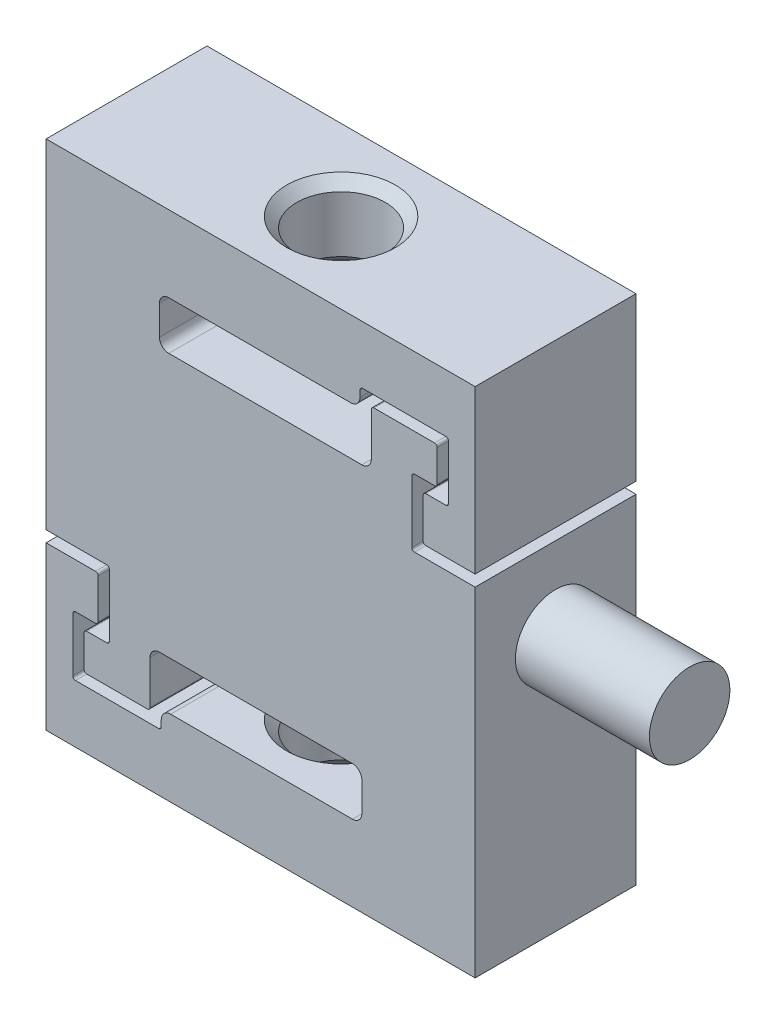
ISO-10303-21;
HEADER;
FILE_DESCRIPTION(('STEP AP214'),'2;1');
FILE_NAME('part.step','',(''),(''),'','','');
FILE_SCHEMA(('AUTOMOTIVE_DESIGN { 1 0 10303 214 1 1 1 1 }'));
ENDSEC;
DATA;
#1=APPLICATION_CONTEXT('core data for automotive mechanical design processes');
#2=APPLICATION_PROTOCOL_DEFINITION('international standard','automotive_design',2000,#1);
#3=PRODUCT_CONTEXT('',#1,'mechanical');
#4=PRODUCT('Part','Part','',(#3));
#5=PRODUCT_RELATED_PRODUCT_CATEGORY('part','',(#4));
#6=PRODUCT_DEFINITION_FORMATION('','',#4);
#7=PRODUCT_DEFINITION_CONTEXT('part definition',#1,'design');
#8=PRODUCT_DEFINITION('design','',#6,#7);
#9=PRODUCT_DEFINITION_SHAPE('','',#8);
#10=(LENGTH_UNIT() NAMED_UNIT(*) SI_UNIT(.MILLI.,.METRE.));
#11=(NAMED_UNIT(*) PLANE_ANGLE_UNIT() SI_UNIT($,.RADIAN.));
#12=(NAMED_UNIT(*) SI_UNIT($,.STERADIAN.) SOLID_ANGLE_UNIT());
#13=UNCERTAINTY_MEASURE_WITH_UNIT(LENGTH_MEASURE(1.E-05),#10,'distance_accuracy_value','');
#14=(GEOMETRIC_REPRESENTATION_CONTEXT(3) GLOBAL_UNCERTAINTY_ASSIGNED_CONTEXT((#13)) GLOBAL_UNIT_ASSIGNED_CONTEXT((#10,
#11,#12)) REPRESENTATION_CONTEXT('',''));
#15=CARTESIAN_POINT('',(0.,0.,0.));
#16=DIRECTION('',(0.,0.,1.));
#17=DIRECTION('',(1.,0.,0.));
#18=AXIS2_PLACEMENT_3D('',#15,#16,#17);
#19=CARTESIAN_POINT('',(-7.99999996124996,9.55004143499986,6.));
#20=DIRECTION('',(1.,0.,0.));
#21=DIRECTION('',(0.,1.,0.));
#22=AXIS2_PLACEMENT_3D('',#19,#20,#21);
#23=PLANE('',#22);
#24=DIRECTION('',(0.,-1.,0.));
#25=VECTOR('',#24,1.);
#26=CARTESIAN_POINT('',(-7.99999996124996,9.55004143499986,0.));
#27=LINE('',#26,#25);
#28=CARTESIAN_POINT('',(-7.99999996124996,9.55004143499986,0.));
#29=VERTEX_POINT('',#28);
#30=CARTESIAN_POINT('',(-7.99999996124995,-3.07430095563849,0.));
#31=VERTEX_POINT('',#30);
#32=EDGE_CURVE('E468',#29,#31,#27,.T.);
#33=ORIENTED_EDGE('',*,*,#32,.T.);
#34=DIRECTION('',(0.,0.,-1.));
#35=VECTOR('',#34,1.);
#36=CARTESIAN_POINT('',(-7.99999996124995,-3.07430095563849,6.));
#37=LINE('',#36,#35);
#38=CARTESIAN_POINT('',(-7.99999996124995,-3.07430095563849,6.));
#39=VERTEX_POINT('',#38);
#40=EDGE_CURVE('E43',#39,#31,#37,.T.);
#41=ORIENTED_EDGE('',*,*,#40,.F.);
#42=DIRECTION('',(0.,-1.,0.));
#43=VECTOR('',#42,1.);
#44=CARTESIAN_POINT('',(-7.99999996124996,9.55004143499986,6.));
#45=LINE('',#44,#43);
#46=CARTESIAN_POINT('',(-7.99999996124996,9.55004143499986,6.));
#47=VERTEX_POINT('',#46);
#48=EDGE_CURVE('E595',#47,#39,#45,.T.);
#49=ORIENTED_EDGE('',*,*,#48,.F.);
#50=DIRECTION('',(0.,0.,-1.));
#51=VECTOR('',#50,1.);
#52=CARTESIAN_POINT('',(-7.99999996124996,9.55004143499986,6.));
#53=LINE('',#52,#51);
#54=EDGE_CURVE('E464',#47,#29,#53,.T.);
#55=ORIENTED_EDGE('',*,*,#54,.T.);
#56=EDGE_LOOP('',(#33,#41,#49,#55));
#57=FACE_BOUND('',#56,.T.);
#58=ADVANCED_FACE('F35',(#57),#23,.F.);
#59=CARTESIAN_POINT('',(-7.99999996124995,-3.07430095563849,6.));
#60=DIRECTION('',(0.,1.,0.));
#61=DIRECTION('',(-1.,0.,0.));
#62=AXIS2_PLACEMENT_3D('',#59,#60,#61);
#63=PLANE('',#62);
#64=DIRECTION('',(1.,0.,0.));
#65=VECTOR('',#64,1.);
#66=CARTESIAN_POINT('',(-7.99999996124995,-3.07430095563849,0.));
#67=LINE('',#66,#65);
#68=CARTESIAN_POINT('',(-5.7401319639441,-3.07430095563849,0.));
#69=VERTEX_POINT('',#68);
#70=EDGE_CURVE('E471',#31,#69,#67,.T.);
#71=ORIENTED_EDGE('',*,*,#70,.T.);
#72=DIRECTION('',(0.,0.,-1.));
#73=VECTOR('',#72,1.);
#74=CARTESIAN_POINT('',(-5.7401319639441,-3.07430095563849,6.));
#75=LINE('',#74,#73);
#76=CARTESIAN_POINT('',(-5.7401319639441,-3.07430095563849,6.));
#77=VERTEX_POINT('',#76);
#78=EDGE_CURVE('E773',#77,#69,#75,.T.);
#79=ORIENTED_EDGE('',*,*,#78,.F.);
#80=DIRECTION('',(1.,0.,0.));
#81=VECTOR('',#80,1.);
#82=CARTESIAN_POINT('',(-7.99999996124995,-3.07430095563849,6.));
#83=LINE('',#82,#81);
#84=EDGE_CURVE('E263',#39,#77,#83,.T.);
#85=ORIENTED_EDGE('',*,*,#84,.F.);
#86=ORIENTED_EDGE('',*,*,#40,.T.);
#87=EDGE_LOOP('',(#71,#79,#85,#86));
#88=FACE_BOUND('',#87,.T.);
#89=ADVANCED_FACE('F776',(#88),#63,.F.);
#90=CARTESIAN_POINT('',(-5.7401319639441,-3.17430095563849,6.));
#91=DIRECTION('',(0.,0.,-1.));
#92=DIRECTION('',(-1.,0.,0.));
#93=AXIS2_PLACEMENT_3D('',#90,#91,#92);
#94=CYLINDRICAL_SURFACE('',#93,0.1);
#95=CARTESIAN_POINT('',(-5.7401319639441,-3.17430095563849,0.));
#96=DIRECTION('',(0.,0.,-1.));
#97=DIRECTION('',(-1.,0.,0.));
#98=AXIS2_PLACEMENT_3D('',#95,#96,#97);
#99=CIRCLE('',#98,0.1);
#100=CARTESIAN_POINT('',(-5.6401319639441,-3.17430095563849,0.));
#101=VERTEX_POINT('',#100);
#102=EDGE_CURVE('E474',#69,#101,#99,.T.);
#103=ORIENTED_EDGE('',*,*,#102,.T.);
#104=DIRECTION('',(0.,0.,-1.));
#105=VECTOR('',#104,1.);
#106=CARTESIAN_POINT('',(-5.6401319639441,-3.17430095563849,6.));
#107=LINE('',#106,#105);
#108=CARTESIAN_POINT('',(-5.6401319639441,-3.17430095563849,6.));
#109=VERTEX_POINT('',#108);
#110=EDGE_CURVE('E770',#109,#101,#107,.T.);
#111=ORIENTED_EDGE('',*,*,#110,.F.);
#112=CARTESIAN_POINT('',(-5.7401319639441,-3.17430095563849,6.));
#113=DIRECTION('',(0.,0.,-1.));
#114=DIRECTION('',(-1.,0.,0.));
#115=AXIS2_PLACEMENT_3D('',#112,#113,#114);
#116=CIRCLE('',#115,0.1);
#117=EDGE_CURVE('E796',#77,#109,#116,.T.);
#118=ORIENTED_EDGE('',*,*,#117,.F.);
#119=ORIENTED_EDGE('',*,*,#78,.T.);
#120=EDGE_LOOP('',(#103,#111,#118,#119));
#121=FACE_BOUND('',#120,.T.);
#122=ADVANCED_FACE('F787',(#121),#94,.F.);
#123=CARTESIAN_POINT('',(-5.6401319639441,-3.17430095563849,6.));
#124=DIRECTION('',(1.,0.,0.));
#125=DIRECTION('',(0.,1.,0.));
#126=AXIS2_PLACEMENT_3D('',#123,#124,#125);
#127=PLANE('',#126);
#128=DIRECTION('',(0.,-1.,0.));
#129=VECTOR('',#128,1.);
#130=CARTESIAN_POINT('',(-5.6401319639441,-3.17430095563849,0.));
#131=LINE('',#130,#129);
#132=CARTESIAN_POINT('',(-5.64013196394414,-5.4935084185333,0.));
#133=VERTEX_POINT('',#132);
#134=EDGE_CURVE('E476',#101,#133,#131,.T.);
#135=ORIENTED_EDGE('',*,*,#134,.T.);
#136=DIRECTION('',(0.,0.,-1.));
#137=VECTOR('',#136,1.);
#138=CARTESIAN_POINT('',(-5.64013196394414,-5.4935084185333,6.));
#139=LINE('',#138,#137);
#140=CARTESIAN_POINT('',(-5.64013196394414,-5.4935084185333,6.));
#141=VERTEX_POINT('',#140);
#142=EDGE_CURVE('E767',#141,#133,#139,.T.);
#143=ORIENTED_EDGE('',*,*,#142,.F.);
#144=DIRECTION('',(0.,-1.,0.));
#145=VECTOR('',#144,1.);
#146=CARTESIAN_POINT('',(-5.6401319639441,-3.17430095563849,6.));
#147=LINE('',#146,#145);
#148=EDGE_CURVE('E793',#109,#141,#147,.T.);
#149=ORIENTED_EDGE('',*,*,#148,.F.);
#150=ORIENTED_EDGE('',*,*,#110,.T.);
#151=EDGE_LOOP('',(#135,#143,#149,#150));
#152=FACE_BOUND('',#151,.T.);
#153=ADVANCED_FACE('F791',(#152),#127,.F.);
#154=CARTESIAN_POINT('',(-5.74013196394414,-5.4935084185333,6.));
#155=DIRECTION('',(0.,0.,-1.));
#156=DIRECTION('',(-1.,0.,0.));
#157=AXIS2_PLACEMENT_3D('',#154,#155,#156);
#158=CYLINDRICAL_SURFACE('',#157,0.1);
#159=CARTESIAN_POINT('',(-5.74013196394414,-5.4935084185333,0.));
#160=DIRECTION('',(0.,0.,-1.));
#161=DIRECTION('',(-1.,0.,0.));
#162=AXIS2_PLACEMENT_3D('',#159,#160,#161);
#163=CIRCLE('',#162,0.1);
#164=CARTESIAN_POINT('',(-5.74013196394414,-5.5935084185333,0.));
#165=VERTEX_POINT('',#164);
#166=EDGE_CURVE('E478',#133,#165,#163,.T.);
#167=ORIENTED_EDGE('',*,*,#166,.T.);
#168=DIRECTION('',(0.,0.,-1.));
#169=VECTOR('',#168,1.);
#170=CARTESIAN_POINT('',(-5.74013196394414,-5.5935084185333,6.));
#171=LINE('',#170,#169);
#172=CARTESIAN_POINT('',(-5.74013196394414,-5.5935084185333,6.));
#173=VERTEX_POINT('',#172);
#174=EDGE_CURVE('E764',#173,#165,#171,.T.);
#175=ORIENTED_EDGE('',*,*,#174,.F.);
#176=CARTESIAN_POINT('',(-5.74013196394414,-5.4935084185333,6.));
#177=DIRECTION('',(0.,0.,-1.));
#178=DIRECTION('',(-1.,0.,0.));
#179=AXIS2_PLACEMENT_3D('',#176,#177,#178);
#180=CIRCLE('',#179,0.1);
#181=EDGE_CURVE('E795',#141,#173,#180,.T.);
#182=ORIENTED_EDGE('',*,*,#181,.F.);
#183=ORIENTED_EDGE('',*,*,#142,.T.);
#184=EDGE_LOOP('',(#167,#175,#182,#183));
#185=FACE_BOUND('',#184,.T.);
#186=ADVANCED_FACE('F1191',(#185),#158,.F.);
#187=CARTESIAN_POINT('',(-5.74013196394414,-5.5935084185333,6.));
#188=DIRECTION('',(0.,-1.,0.));
#189=DIRECTION('',(1.,0.,0.));
#190=AXIS2_PLACEMENT_3D('',#187,#188,#189);
#191=PLANE('',#190);
#192=DIRECTION('',(-1.,0.,0.));
#193=VECTOR('',#192,1.);
#194=CARTESIAN_POINT('',(-5.74013196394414,-5.5935084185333,0.));
#195=LINE('',#194,#193);
#196=CARTESIAN_POINT('',(-6.48483476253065,-5.5935084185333,0.));
#197=VERTEX_POINT('',#196);
#198=EDGE_CURVE('E480',#165,#197,#195,.T.);
#199=ORIENTED_EDGE('',*,*,#198,.T.);
#200=DIRECTION('',(0.,0.,-1.));
#201=VECTOR('',#200,1.);
#202=CARTESIAN_POINT('',(-6.48483476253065,-5.5935084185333,6.));
#203=LINE('',#202,#201);
#204=CARTESIAN_POINT('',(-6.48483476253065,-5.5935084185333,6.));
#205=VERTEX_POINT('',#204);
#206=EDGE_CURVE('E761',#205,#197,#203,.T.);
#207=ORIENTED_EDGE('',*,*,#206,.F.);
#208=DIRECTION('',(-1.,0.,0.));
#209=VECTOR('',#208,1.);
#210=CARTESIAN_POINT('',(-5.74013196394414,-5.5935084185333,6.));
#211=LINE('',#210,#209);
#212=EDGE_CURVE('E798',#173,#205,#211,.T.);
#213=ORIENTED_EDGE('',*,*,#212,.F.);
#214=ORIENTED_EDGE('',*,*,#174,.T.);
#215=EDGE_LOOP('',(#199,#207,#213,#214));
#216=FACE_BOUND('',#215,.T.);
#217=ADVANCED_FACE('F1188',(#216),#191,.F.);
#218=CARTESIAN_POINT('',(-6.48483476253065,-5.6935084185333,6.));
#219=DIRECTION('',(0.,0.,-1.));
#220=DIRECTION('',(-1.,0.,0.));
#221=AXIS2_PLACEMENT_3D('',#218,#219,#220);
#222=CYLINDRICAL_SURFACE('',#221,0.099999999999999);
#223=CARTESIAN_POINT('',(-6.48483476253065,-5.6935084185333,0.));
#224=DIRECTION('',(0.,0.,1.));
#225=DIRECTION('',(1.,0.,0.));
#226=AXIS2_PLACEMENT_3D('',#223,#224,#225);
#227=CIRCLE('',#226,0.099999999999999);
#228=CARTESIAN_POINT('',(-6.58483476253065,-5.6935084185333,0.));
#229=VERTEX_POINT('',#228);
#230=EDGE_CURVE('E482',#197,#229,#227,.T.);
#231=ORIENTED_EDGE('',*,*,#230,.T.);
#232=DIRECTION('',(0.,0.,-1.));
#233=VECTOR('',#232,1.);
#234=CARTESIAN_POINT('',(-6.58483476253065,-5.6935084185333,6.));
#235=LINE('',#234,#233);
#236=CARTESIAN_POINT('',(-6.58483476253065,-5.6935084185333,6.));
#237=VERTEX_POINT('',#236);
#238=EDGE_CURVE('E758',#237,#229,#235,.T.);
#239=ORIENTED_EDGE('',*,*,#238,.F.);
#240=CARTESIAN_POINT('',(-6.48483476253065,-5.6935084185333,6.));
#241=DIRECTION('',(0.,0.,1.));
#242=DIRECTION('',(1.,0.,0.));
#243=AXIS2_PLACEMENT_3D('',#240,#241,#242);
#244=CIRCLE('',#243,0.099999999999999);
#245=EDGE_CURVE('E804',#205,#237,#244,.T.);
#246=ORIENTED_EDGE('',*,*,#245,.F.);
#247=ORIENTED_EDGE('',*,*,#206,.T.);
#248=EDGE_LOOP('',(#231,#239,#246,#247));
#249=FACE_BOUND('',#248,.T.);
#250=ADVANCED_FACE('F1184',(#249),#222,.T.);
#251=CARTESIAN_POINT('',(-6.58483476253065,-5.6935084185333,6.));
#252=DIRECTION('',(1.,0.,0.));
#253=DIRECTION('',(0.,1.,0.));
#254=AXIS2_PLACEMENT_3D('',#251,#252,#253);
#255=PLANE('',#254);
#256=DIRECTION('',(0.,-1.,0.));
#257=VECTOR('',#256,1.);
#258=CARTESIAN_POINT('',(-6.58483476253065,-5.6935084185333,0.));
#259=LINE('',#258,#257);
#260=CARTESIAN_POINT('',(-6.58483476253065,-6.87366060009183,0.));
#261=VERTEX_POINT('',#260);
#262=EDGE_CURVE('E484',#229,#261,#259,.T.);
#263=ORIENTED_EDGE('',*,*,#262,.T.);
#264=DIRECTION('',(0.,0.,-1.));
#265=VECTOR('',#264,1.);
#266=CARTESIAN_POINT('',(-6.58483476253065,-6.87366060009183,6.));
#267=LINE('',#266,#265);
#268=CARTESIAN_POINT('',(-6.58483476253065,-6.87366060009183,6.));
#269=VERTEX_POINT('',#268);
#270=EDGE_CURVE('E755',#269,#261,#267,.T.);
#271=ORIENTED_EDGE('',*,*,#270,.F.);
#272=DIRECTION('',(0.,-1.,0.));
#273=VECTOR('',#272,1.);
#274=CARTESIAN_POINT('',(-6.58483476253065,-5.6935084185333,6.));
#275=LINE('',#274,#273);
#276=EDGE_CURVE('E806',#237,#269,#275,.T.);
#277=ORIENTED_EDGE('',*,*,#276,.F.);
#278=ORIENTED_EDGE('',*,*,#238,.T.);
#279=EDGE_LOOP('',(#263,#271,#277,#278));
#280=FACE_BOUND('',#279,.T.);
#281=ADVANCED_FACE('F1179',(#280),#255,.F.);
#282=CARTESIAN_POINT('',(-6.48483476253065,-6.87366060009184,6.));
#283=DIRECTION('',(0.,0.,-1.));
#284=DIRECTION('',(-1.,0.,0.));
#285=AXIS2_PLACEMENT_3D('',#282,#283,#284);
#286=CYLINDRICAL_SURFACE('',#285,0.1);
#287=CARTESIAN_POINT('',(-6.48483476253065,-6.87366060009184,0.));
#288=DIRECTION('',(0.,0.,1.));
#289=DIRECTION('',(1.,0.,0.));
#290=AXIS2_PLACEMENT_3D('',#287,#288,#289);
#291=CIRCLE('',#290,0.1);
#292=CARTESIAN_POINT('',(-6.48483476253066,-6.97366060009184,0.));
#293=VERTEX_POINT('',#292);
#294=EDGE_CURVE('E486',#261,#293,#291,.T.);
#295=ORIENTED_EDGE('',*,*,#294,.T.);
#296=DIRECTION('',(0.,0.,-1.));
#297=VECTOR('',#296,1.);
#298=CARTESIAN_POINT('',(-6.48483476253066,-6.97366060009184,6.));
#299=LINE('',#298,#297);
#300=CARTESIAN_POINT('',(-6.48483476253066,-6.97366060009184,6.));
#301=VERTEX_POINT('',#300);
#302=EDGE_CURVE('E752',#301,#293,#299,.T.);
#303=ORIENTED_EDGE('',*,*,#302,.F.);
#304=CARTESIAN_POINT('',(-6.48483476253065,-6.87366060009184,6.));
#305=DIRECTION('',(0.,0.,1.));
#306=DIRECTION('',(1.,0.,0.));
#307=AXIS2_PLACEMENT_3D('',#304,#305,#306);
#308=CIRCLE('',#307,0.1);
#309=EDGE_CURVE('E808',#269,#301,#308,.T.);
#310=ORIENTED_EDGE('',*,*,#309,.F.);
#311=ORIENTED_EDGE('',*,*,#270,.T.);
#312=EDGE_LOOP('',(#295,#303,#310,#311));
#313=FACE_BOUND('',#312,.T.);
#314=ADVANCED_FACE('F1173',(#313),#286,.T.);
#315=CARTESIAN_POINT('',(-6.48483476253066,-6.97366060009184,6.));
#316=DIRECTION('',(0.,1.,0.));
#317=DIRECTION('',(-1.,0.,0.));
#318=AXIS2_PLACEMENT_3D('',#315,#316,#317);
#319=PLANE('',#318);
#320=DIRECTION('',(1.,0.,0.));
#321=VECTOR('',#320,1.);
#322=CARTESIAN_POINT('',(-6.48483476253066,-6.97366060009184,0.));
#323=LINE('',#322,#321);
#324=CARTESIAN_POINT('',(-4.22626694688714,-6.97366060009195,0.));
#325=VERTEX_POINT('',#324);
#326=EDGE_CURVE('E488',#293,#325,#323,.T.);
#327=ORIENTED_EDGE('',*,*,#326,.T.);
#328=DIRECTION('',(0.,0.,-1.));
#329=VECTOR('',#328,1.);
#330=CARTESIAN_POINT('',(-4.22626694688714,-6.97366060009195,6.));
#331=LINE('',#330,#329);
#332=CARTESIAN_POINT('',(-4.22626694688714,-6.97366060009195,6.));
#333=VERTEX_POINT('',#332);
#334=EDGE_CURVE('E749',#333,#325,#331,.T.);
#335=ORIENTED_EDGE('',*,*,#334,.F.);
#336=DIRECTION('',(1.,0.,0.));
#337=VECTOR('',#336,1.);
#338=CARTESIAN_POINT('',(-6.48483476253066,-6.97366060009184,6.));
#339=LINE('',#338,#337);
#340=EDGE_CURVE('E810',#301,#333,#339,.T.);
#341=ORIENTED_EDGE('',*,*,#340,.F.);
#342=ORIENTED_EDGE('',*,*,#302,.T.);
#343=EDGE_LOOP('',(#327,#335,#341,#342));
#344=FACE_BOUND('',#343,.T.);
#345=ADVANCED_FACE('F1169',(#344),#319,.F.);
#346=CARTESIAN_POINT('',(-4.22626694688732,-6.87366060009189,6.));
#347=DIRECTION('',(0.,0.,-1.));
#348=DIRECTION('',(-1.,0.,0.));
#349=AXIS2_PLACEMENT_3D('',#346,#347,#348);
#350=CYLINDRICAL_SURFACE('',#349,0.100000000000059);
#351=CARTESIAN_POINT('',(-4.22626694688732,-6.87366060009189,0.));
#352=DIRECTION('',(0.,0.,1.));
#353=DIRECTION('',(1.,0.,0.));
#354=AXIS2_PLACEMENT_3D('',#351,#352,#353);
#355=CIRCLE('',#354,0.100000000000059);
#356=CARTESIAN_POINT('',(-4.12626694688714,-6.87366060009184,0.));
#357=VERTEX_POINT('',#356);
#358=EDGE_CURVE('E490',#325,#357,#355,.T.);
#359=ORIENTED_EDGE('',*,*,#358,.T.);
#360=DIRECTION('',(0.,0.,-1.));
#361=VECTOR('',#360,1.);
#362=CARTESIAN_POINT('',(-4.12626694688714,-6.87366060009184,6.));
#363=LINE('',#362,#361);
#364=CARTESIAN_POINT('',(-4.12626694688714,-6.87366060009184,6.));
#365=VERTEX_POINT('',#364);
#366=EDGE_CURVE('E746',#365,#357,#363,.T.);
#367=ORIENTED_EDGE('',*,*,#366,.F.);
#368=CARTESIAN_POINT('',(-4.22626694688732,-6.87366060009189,6.));
#369=DIRECTION('',(0.,0.,1.));
#370=DIRECTION('',(1.,0.,0.));
#371=AXIS2_PLACEMENT_3D('',#368,#369,#370);
#372=CIRCLE('',#371,0.100000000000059);
#373=EDGE_CURVE('E812',#333,#365,#372,.T.);
#374=ORIENTED_EDGE('',*,*,#373,.F.);
#375=ORIENTED_EDGE('',*,*,#334,.T.);
#376=EDGE_LOOP('',(#359,#367,#374,#375));
#377=FACE_BOUND('',#376,.T.);
#378=ADVANCED_FACE('F1164',(#377),#350,.T.);
#379=CARTESIAN_POINT('',(-4.12626694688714,-6.87366060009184,6.));
#380=DIRECTION('',(-1.,0.,0.));
#381=DIRECTION('',(0.,-1.,0.));
#382=AXIS2_PLACEMENT_3D('',#379,#380,#381);
#383=PLANE('',#382);
#384=DIRECTION('',(0.,1.,0.));
#385=VECTOR('',#384,1.);
#386=CARTESIAN_POINT('',(-4.12626694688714,-6.87366060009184,0.));
#387=LINE('',#386,#385);
#388=CARTESIAN_POINT('',(-4.12626694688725,-5.26185791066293,0.));
#389=VERTEX_POINT('',#388);
#390=EDGE_CURVE('E492',#357,#389,#387,.T.);
#391=ORIENTED_EDGE('',*,*,#390,.T.);
#392=DIRECTION('',(0.,0.,-1.));
#393=VECTOR('',#392,1.);
#394=CARTESIAN_POINT('',(-4.12626694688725,-5.26185791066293,6.));
#395=LINE('',#394,#393);
#396=CARTESIAN_POINT('',(-4.12626694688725,-5.26185791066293,6.));
#397=VERTEX_POINT('',#396);
#398=EDGE_CURVE('E743',#397,#389,#395,.T.);
#399=ORIENTED_EDGE('',*,*,#398,.F.);
#400=DIRECTION('',(0.,1.,0.));
#401=VECTOR('',#400,1.);
#402=CARTESIAN_POINT('',(-4.12626694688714,-6.87366060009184,6.));
#403=LINE('',#402,#401);
#404=EDGE_CURVE('E814',#365,#397,#403,.T.);
#405=ORIENTED_EDGE('',*,*,#404,.F.);
#406=ORIENTED_EDGE('',*,*,#366,.T.);
#407=EDGE_LOOP('',(#391,#399,#405,#406));
#408=FACE_BOUND('',#407,.T.);
#409=ADVANCED_FACE('F1158',(#408),#383,.F.);
#410=CARTESIAN_POINT('',(-3.77626694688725,-5.26185791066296,6.));
#411=DIRECTION('',(0.,0.,-1.));
#412=DIRECTION('',(-1.,0.,0.));
#413=AXIS2_PLACEMENT_3D('',#410,#411,#412);
#414=CYLINDRICAL_SURFACE('',#413,0.350000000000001);
#415=CARTESIAN_POINT('',(-3.77626694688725,-5.26185791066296,0.));
#416=DIRECTION('',(0.,0.,-1.));
#417=DIRECTION('',(-1.,0.,0.));
#418=AXIS2_PLACEMENT_3D('',#415,#416,#417);
#419=CIRCLE('',#418,0.350000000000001);
#420=CARTESIAN_POINT('',(-3.77626694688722,-4.91185791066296,0.));
#421=VERTEX_POINT('',#420);
#422=EDGE_CURVE('E494',#389,#421,#419,.T.);
#423=ORIENTED_EDGE('',*,*,#422,.T.);
#424=DIRECTION('',(0.,0.,-1.));
#425=VECTOR('',#424,1.);
#426=CARTESIAN_POINT('',(-3.77626694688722,-4.91185791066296,6.));
#427=LINE('',#426,#425);
#428=CARTESIAN_POINT('',(-3.77626694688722,-4.91185791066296,6.));
#429=VERTEX_POINT('',#428);
#430=EDGE_CURVE('E740',#429,#421,#427,.T.);
#431=ORIENTED_EDGE('',*,*,#430,.F.);
#432=CARTESIAN_POINT('',(-3.77626694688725,-5.26185791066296,6.));
#433=DIRECTION('',(0.,0.,-1.));
#434=DIRECTION('',(-1.,0.,0.));
#435=AXIS2_PLACEMENT_3D('',#432,#433,#434);
#436=CIRCLE('',#435,0.350000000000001);
#437=EDGE_CURVE('E816',#397,#429,#436,.T.);
#438=ORIENTED_EDGE('',*,*,#437,.F.);
#439=ORIENTED_EDGE('',*,*,#398,.T.);
#440=EDGE_LOOP('',(#423,#431,#438,#439));
#441=FACE_BOUND('',#440,.T.);
#442=ADVANCED_FACE('F1154',(#441),#414,.F.);
#443=CARTESIAN_POINT('',(-3.77626694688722,-4.91185791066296,6.));
#444=DIRECTION('',(0.,1.,0.));
#445=DIRECTION('',(-1.,0.,0.));
#446=AXIS2_PLACEMENT_3D('',#443,#444,#445);
#447=PLANE('',#446);
#448=DIRECTION('',(1.,0.,0.));
#449=VECTOR('',#448,1.);
#450=CARTESIAN_POINT('',(-3.77626694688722,-4.91185791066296,0.));
#451=LINE('',#450,#449);
#452=CARTESIAN_POINT('',(3.4235995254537,-4.91185791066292,0.));
#453=VERTEX_POINT('',#452);
#454=EDGE_CURVE('E496',#421,#453,#451,.T.);
#455=ORIENTED_EDGE('',*,*,#454,.T.);
#456=DIRECTION('',(0.,0.,-1.));
#457=VECTOR('',#456,1.);
#458=CARTESIAN_POINT('',(3.4235995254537,-4.91185791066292,6.));
#459=LINE('',#458,#457);
#460=CARTESIAN_POINT('',(3.4235995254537,-4.91185791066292,6.));
#461=VERTEX_POINT('',#460);
#462=EDGE_CURVE('E737',#461,#453,#459,.T.);
#463=ORIENTED_EDGE('',*,*,#462,.F.);
#464=DIRECTION('',(1.,0.,0.));
#465=VECTOR('',#464,1.);
#466=CARTESIAN_POINT('',(-3.77626694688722,-4.91185791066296,6.));
#467=LINE('',#466,#465);
#468=EDGE_CURVE('E818',#429,#461,#467,.T.);
#469=ORIENTED_EDGE('',*,*,#468,.F.);
#470=ORIENTED_EDGE('',*,*,#430,.T.);
#471=EDGE_LOOP('',(#455,#463,#469,#470));
#472=FACE_BOUND('',#471,.T.);
#473=ADVANCED_FACE('F1149',(#472),#447,.F.);
#474=CARTESIAN_POINT('',(3.4235995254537,-5.26185791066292,6.));
#475=DIRECTION('',(0.,0.,-1.));
#476=DIRECTION('',(-1.,0.,0.));
#477=AXIS2_PLACEMENT_3D('',#474,#475,#476);
#478=CYLINDRICAL_SURFACE('',#477,0.350000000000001);
#479=CARTESIAN_POINT('',(3.4235995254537,-5.26185791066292,0.));
#480=DIRECTION('',(0.,0.,-1.));
#481=DIRECTION('',(-1.,0.,0.));
#482=AXIS2_PLACEMENT_3D('',#479,#480,#481);
#483=CIRCLE('',#482,0.350000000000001);
#484=CARTESIAN_POINT('',(3.7735995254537,-5.26185791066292,0.));
#485=VERTEX_POINT('',#484);
#486=EDGE_CURVE('E498',#453,#485,#483,.T.);
#487=ORIENTED_EDGE('',*,*,#486,.T.);
#488=DIRECTION('',(0.,0.,-1.));
#489=VECTOR('',#488,1.);
#490=CARTESIAN_POINT('',(3.7735995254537,-5.26185791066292,6.));
#491=LINE('',#490,#489);
#492=CARTESIAN_POINT('',(3.7735995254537,-5.26185791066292,6.));
#493=VERTEX_POINT('',#492);
#494=EDGE_CURVE('E734',#493,#485,#491,.T.);
#495=ORIENTED_EDGE('',*,*,#494,.F.);
#496=CARTESIAN_POINT('',(3.4235995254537,-5.26185791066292,6.));
#497=DIRECTION('',(0.,0.,-1.));
#498=DIRECTION('',(-1.,0.,0.));
#499=AXIS2_PLACEMENT_3D('',#496,#497,#498);
#500=CIRCLE('',#499,0.350000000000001);
#501=EDGE_CURVE('E820',#461,#493,#500,.T.);
#502=ORIENTED_EDGE('',*,*,#501,.F.);
#503=ORIENTED_EDGE('',*,*,#462,.T.);
#504=EDGE_LOOP('',(#487,#495,#502,#503));
#505=FACE_BOUND('',#504,.T.);
#506=ADVANCED_FACE('F1143',(#505),#478,.F.);
#507=CARTESIAN_POINT('',(3.7735995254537,-5.26185791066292,6.));
#508=DIRECTION('',(1.,0.,0.));
#509=DIRECTION('',(0.,1.,0.));
#510=AXIS2_PLACEMENT_3D('',#507,#508,#509);
#511=PLANE('',#510);
#512=DIRECTION('',(0.,-1.,0.));
#513=VECTOR('',#512,1.);
#514=CARTESIAN_POINT('',(3.7735995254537,-5.26185791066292,0.));
#515=LINE('',#514,#513);
#516=CARTESIAN_POINT('',(3.7735995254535,-6.35821206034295,0.));
#517=VERTEX_POINT('',#516);
#518=EDGE_CURVE('E500',#485,#517,#515,.T.);
#519=ORIENTED_EDGE('',*,*,#518,.T.);
#520=DIRECTION('',(0.,0.,-1.));
#521=VECTOR('',#520,1.);
#522=CARTESIAN_POINT('',(3.7735995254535,-6.35821206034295,6.));
#523=LINE('',#522,#521);
#524=CARTESIAN_POINT('',(3.7735995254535,-6.35821206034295,6.));
#525=VERTEX_POINT('',#524);
#526=EDGE_CURVE('E731',#525,#517,#523,.T.);
#527=ORIENTED_EDGE('',*,*,#526,.F.);
#528=DIRECTION('',(0.,-1.,0.));
#529=VECTOR('',#528,1.);
#530=CARTESIAN_POINT('',(3.7735995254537,-5.26185791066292,6.));
#531=LINE('',#530,#529);
#532=EDGE_CURVE('E822',#493,#525,#531,.T.);
#533=ORIENTED_EDGE('',*,*,#532,.F.);
#534=ORIENTED_EDGE('',*,*,#494,.T.);
#535=EDGE_LOOP('',(#519,#527,#533,#534));
#536=FACE_BOUND('',#535,.T.);
#537=ADVANCED_FACE('F1139',(#536),#511,.F.);
#538=CARTESIAN_POINT('',(3.42359952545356,-6.3582120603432,6.));
#539=DIRECTION('',(0.,0.,-1.));
#540=DIRECTION('',(-1.,0.,0.));
#541=AXIS2_PLACEMENT_3D('',#538,#539,#540);
#542=CYLINDRICAL_SURFACE('',#541,0.349999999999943);
#543=CARTESIAN_POINT('',(3.42359952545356,-6.3582120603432,0.));
#544=DIRECTION('',(0.,0.,-1.));
#545=DIRECTION('',(-1.,0.,0.));
#546=AXIS2_PLACEMENT_3D('',#543,#544,#545);
#547=CIRCLE('',#546,0.349999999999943);
#548=CARTESIAN_POINT('',(3.4235995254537,-6.70821206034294,0.));
#549=VERTEX_POINT('',#548);
#550=EDGE_CURVE('E502',#517,#549,#547,.T.);
#551=ORIENTED_EDGE('',*,*,#550,.T.);
#552=DIRECTION('',(0.,0.,-1.));
#553=VECTOR('',#552,1.);
#554=CARTESIAN_POINT('',(3.4235995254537,-6.70821206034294,6.));
#555=LINE('',#554,#553);
#556=CARTESIAN_POINT('',(3.4235995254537,-6.70821206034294,6.));
#557=VERTEX_POINT('',#556);
#558=EDGE_CURVE('E728',#557,#549,#555,.T.);
#559=ORIENTED_EDGE('',*,*,#558,.F.);
#560=CARTESIAN_POINT('',(3.42359952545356,-6.3582120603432,6.));
#561=DIRECTION('',(0.,0.,-1.));
#562=DIRECTION('',(-1.,0.,0.));
#563=AXIS2_PLACEMENT_3D('',#560,#561,#562);
#564=CIRCLE('',#563,0.349999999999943);
#565=EDGE_CURVE('E824',#525,#557,#564,.T.);
#566=ORIENTED_EDGE('',*,*,#565,.F.);
#567=ORIENTED_EDGE('',*,*,#526,.T.);
#568=EDGE_LOOP('',(#551,#559,#566,#567));
#569=FACE_BOUND('',#568,.T.);
#570=ADVANCED_FACE('F1134',(#569),#542,.F.);
#571=CARTESIAN_POINT('',(3.4235995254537,-6.70821206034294,6.));
#572=DIRECTION('',(0.,-1.,0.));
#573=DIRECTION('',(1.,0.,0.));
#574=AXIS2_PLACEMENT_3D('',#571,#572,#573);
#575=PLANE('',#574);
#576=CARTESIAN_POINT('',(0.,-6.70821206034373,3.));
#577=DIRECTION('',(0.,-1.,0.));
#578=DIRECTION('',(0.,0.,-1.));
#579=AXIS2_PLACEMENT_3D('',#576,#577,#578);
#580=CIRCLE('',#579,2.025);
#581=CARTESIAN_POINT('',(0.,-6.70821206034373,0.975000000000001));
#582=VERTEX_POINT('',#581);
#583=EDGE_CURVE('E1804',#582,#582,#580,.T.);
#584=ORIENTED_EDGE('',*,*,#583,.T.);
#585=EDGE_LOOP('',(#584));
#586=FACE_BOUND('',#585,.T.);
#587=DIRECTION('',(-1.,0.,0.));
#588=VECTOR('',#587,1.);
#589=CARTESIAN_POINT('',(3.4235995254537,-6.70821206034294,0.));
#590=LINE('',#589,#588);
#591=CARTESIAN_POINT('',(-3.35626694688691,-6.70821206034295,0.));
#592=VERTEX_POINT('',#591);
#593=EDGE_CURVE('E504',#549,#592,#590,.T.);
#594=ORIENTED_EDGE('',*,*,#593,.T.);
#595=DIRECTION('',(0.,0.,-1.));
#596=VECTOR('',#595,1.);
#597=CARTESIAN_POINT('',(-3.35626694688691,-6.70821206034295,6.));
#598=LINE('',#597,#596);
#599=CARTESIAN_POINT('',(-3.35626694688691,-6.70821206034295,6.));
#600=VERTEX_POINT('',#599);
#601=EDGE_CURVE('E725',#600,#592,#598,.T.);
#602=ORIENTED_EDGE('',*,*,#601,.F.);
#603=DIRECTION('',(-1.,0.,0.));
#604=VECTOR('',#603,1.);
#605=CARTESIAN_POINT('',(3.4235995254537,-6.70821206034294,6.));
#606=LINE('',#605,#604);
#607=EDGE_CURVE('E826',#557,#600,#606,.T.);
#608=ORIENTED_EDGE('',*,*,#607,.F.);
#609=ORIENTED_EDGE('',*,*,#558,.T.);
#610=EDGE_LOOP('',(#594,#602,#608,#609));
#611=FACE_BOUND('',#610,.T.);
#612=ADVANCED_FACE('F1128',(#586,#611),#575,.F.);
#613=CARTESIAN_POINT('',(-3.35626694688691,-7.05821206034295,6.));
#614=DIRECTION('',(0.,0.,-1.));
#615=DIRECTION('',(-1.,0.,0.));
#616=AXIS2_PLACEMENT_3D('',#613,#614,#615);
#617=CYLINDRICAL_SURFACE('',#616,0.349999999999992);
#618=CARTESIAN_POINT('',(-3.35626694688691,-7.05821206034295,0.));
#619=DIRECTION('',(0.,0.,1.));
#620=DIRECTION('',(1.,0.,0.));
#621=AXIS2_PLACEMENT_3D('',#618,#619,#620);
#622=CIRCLE('',#621,0.349999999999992);
#623=CARTESIAN_POINT('',(-3.7062669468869,-7.05821206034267,0.));
#624=VERTEX_POINT('',#623);
#625=EDGE_CURVE('E506',#592,#624,#622,.T.);
#626=ORIENTED_EDGE('',*,*,#625,.T.);
#627=DIRECTION('',(0.,0.,-1.));
#628=VECTOR('',#627,1.);
#629=CARTESIAN_POINT('',(-3.7062669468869,-7.05821206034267,6.));
#630=LINE('',#629,#628);
#631=CARTESIAN_POINT('',(-3.7062669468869,-7.05821206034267,6.));
#632=VERTEX_POINT('',#631);
#633=EDGE_CURVE('E722',#632,#624,#630,.T.);
#634=ORIENTED_EDGE('',*,*,#633,.F.);
#635=CARTESIAN_POINT('',(-3.35626694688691,-7.05821206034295,6.));
#636=DIRECTION('',(0.,0.,1.));
#637=DIRECTION('',(1.,0.,0.));
#638=AXIS2_PLACEMENT_3D('',#635,#636,#637);
#639=CIRCLE('',#638,0.349999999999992);
#640=EDGE_CURVE('E828',#600,#632,#639,.T.);
#641=ORIENTED_EDGE('',*,*,#640,.F.);
#642=ORIENTED_EDGE('',*,*,#601,.T.);
#643=EDGE_LOOP('',(#626,#634,#641,#642));
#644=FACE_BOUND('',#643,.T.);
#645=ADVANCED_FACE('F1124',(#644),#617,.T.);
#646=CARTESIAN_POINT('',(-3.70626694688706,-7.29366060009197,6.));
#647=DIRECTION('',(1.,-6.79673956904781E-13,0.));
#648=DIRECTION('',(6.79673956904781E-13,1.,0.));
#649=AXIS2_PLACEMENT_3D('',#646,#647,#648);
#650=PLANE('',#649);
#651=DIRECTION('',(-6.79673956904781E-13,-1.,0.));
#652=VECTOR('',#651,1.);
#653=CARTESIAN_POINT('',(-3.70626694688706,-7.29366060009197,0.));
#654=LINE('',#653,#652);
#655=CARTESIAN_POINT('',(-3.70626694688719,-7.29366060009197,0.));
#656=VERTEX_POINT('',#655);
#657=EDGE_CURVE('E508',#624,#656,#654,.T.);
#658=ORIENTED_EDGE('',*,*,#657,.T.);
#659=DIRECTION('',(0.,0.,-1.));
#660=VECTOR('',#659,1.);
#661=CARTESIAN_POINT('',(-3.70626694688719,-7.29366060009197,6.));
#662=LINE('',#661,#660);
#663=CARTESIAN_POINT('',(-3.70626694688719,-7.29366060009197,6.));
#664=VERTEX_POINT('',#663);
#665=EDGE_CURVE('E719',#664,#656,#662,.T.);
#666=ORIENTED_EDGE('',*,*,#665,.F.);
#667=DIRECTION('',(-6.79673956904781E-13,-1.,0.));
#668=VECTOR('',#667,1.);
#669=CARTESIAN_POINT('',(-3.70626694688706,-7.29366060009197,6.));
#670=LINE('',#669,#668);
#671=EDGE_CURVE('E830',#632,#664,#670,.T.);
#672=ORIENTED_EDGE('',*,*,#671,.F.);
#673=ORIENTED_EDGE('',*,*,#633,.T.);
#674=EDGE_LOOP('',(#658,#666,#672,#673));
#675=FACE_BOUND('',#674,.T.);
#676=ADVANCED_FACE('F1119',(#675),#650,.F.);
#677=CARTESIAN_POINT('',(-3.80626694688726,-7.29366060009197,6.));
#678=DIRECTION('',(0.,0.,-1.));
#679=DIRECTION('',(-1.,0.,0.));
#680=AXIS2_PLACEMENT_3D('',#677,#678,#679);
#681=CYLINDRICAL_SURFACE('',#680,0.100000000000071);
#682=CARTESIAN_POINT('',(-3.80626694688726,-7.29366060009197,0.));
#683=DIRECTION('',(0.,0.,-1.));
#684=DIRECTION('',(1.,0.,0.));
#685=AXIS2_PLACEMENT_3D('',#682,#683,#684);
#686=CIRCLE('',#685,0.100000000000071);
#687=CARTESIAN_POINT('',(-3.80626694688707,-7.3936606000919,0.));
#688=VERTEX_POINT('',#687);
#689=EDGE_CURVE('E510',#656,#688,#686,.T.);
#690=ORIENTED_EDGE('',*,*,#689,.T.);
#691=DIRECTION('',(0.,0.,-1.));
#692=VECTOR('',#691,1.);
#693=CARTESIAN_POINT('',(-3.80626694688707,-7.3936606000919,6.));
#694=LINE('',#693,#692);
#695=CARTESIAN_POINT('',(-3.80626694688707,-7.3936606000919,6.));
#696=VERTEX_POINT('',#695);
#697=EDGE_CURVE('E716',#696,#688,#694,.T.);
#698=ORIENTED_EDGE('',*,*,#697,.F.);
#699=CARTESIAN_POINT('',(-3.80626694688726,-7.29366060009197,6.));
#700=DIRECTION('',(0.,0.,-1.));
#701=DIRECTION('',(1.,0.,0.));
#702=AXIS2_PLACEMENT_3D('',#699,#700,#701);
#703=CIRCLE('',#702,0.100000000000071);
#704=EDGE_CURVE('E832',#664,#696,#703,.T.);
#705=ORIENTED_EDGE('',*,*,#704,.F.);
#706=ORIENTED_EDGE('',*,*,#665,.T.);
#707=EDGE_LOOP('',(#690,#698,#705,#706));
#708=FACE_BOUND('',#707,.T.);
#709=ADVANCED_FACE('F1113',(#708),#681,.F.);
#710=CARTESIAN_POINT('',(-6.90483476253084,-7.3936606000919,6.));
#711=DIRECTION('',(0.,-1.,0.));
#712=DIRECTION('',(1.,0.,0.));
#713=AXIS2_PLACEMENT_3D('',#710,#711,#712);
#714=PLANE('',#713);
#715=DIRECTION('',(-1.,0.,0.));
#716=VECTOR('',#715,1.);
#717=CARTESIAN_POINT('',(-6.90483476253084,-7.3936606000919,0.));
#718=LINE('',#717,#716);
#719=CARTESIAN_POINT('',(-6.90483476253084,-7.3936606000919,0.));
#720=VERTEX_POINT('',#719);
#721=EDGE_CURVE('E512',#688,#720,#718,.T.);
#722=ORIENTED_EDGE('',*,*,#721,.T.);
#723=DIRECTION('',(0.,0.,-1.));
#724=VECTOR('',#723,1.);
#725=CARTESIAN_POINT('',(-6.90483476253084,-7.3936606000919,6.));
#726=LINE('',#725,#724);
#727=CARTESIAN_POINT('',(-6.90483476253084,-7.3936606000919,6.));
#728=VERTEX_POINT('',#727);
#729=EDGE_CURVE('E713',#728,#720,#726,.T.);
#730=ORIENTED_EDGE('',*,*,#729,.F.);
#731=DIRECTION('',(-1.,0.,0.));
#732=VECTOR('',#731,1.);
#733=CARTESIAN_POINT('',(-6.90483476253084,-7.3936606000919,6.));
#734=LINE('',#733,#732);
#735=EDGE_CURVE('E834',#696,#728,#734,.T.);
#736=ORIENTED_EDGE('',*,*,#735,.F.);
#737=ORIENTED_EDGE('',*,*,#697,.T.);
#738=EDGE_LOOP('',(#722,#730,#736,#737));
#739=FACE_BOUND('',#738,.T.);
#740=ADVANCED_FACE('F1109',(#739),#714,.F.);
#741=CARTESIAN_POINT('',(-6.90483476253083,-7.2936606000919,6.));
#742=DIRECTION('',(0.,0.,-1.));
#743=DIRECTION('',(-1.,0.,0.));
#744=AXIS2_PLACEMENT_3D('',#741,#742,#743);
#745=CYLINDRICAL_SURFACE('',#744,0.0999999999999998);
#746=CARTESIAN_POINT('',(-6.90483476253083,-7.2936606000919,0.));
#747=DIRECTION('',(0.,0.,-1.));
#748=DIRECTION('',(1.,0.,0.));
#749=AXIS2_PLACEMENT_3D('',#746,#747,#748);
#750=CIRCLE('',#749,0.0999999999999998);
#751=CARTESIAN_POINT('',(-7.00483476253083,-7.29366060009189,0.));
#752=VERTEX_POINT('',#751);
#753=EDGE_CURVE('E514',#720,#752,#750,.T.);
#754=ORIENTED_EDGE('',*,*,#753,.T.);
#755=DIRECTION('',(0.,0.,-1.));
#756=VECTOR('',#755,1.);
#757=CARTESIAN_POINT('',(-7.00483476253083,-7.29366060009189,6.));
#758=LINE('',#757,#756);
#759=CARTESIAN_POINT('',(-7.00483476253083,-7.29366060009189,6.));
#760=VERTEX_POINT('',#759);
#761=EDGE_CURVE('E710',#760,#752,#758,.T.);
#762=ORIENTED_EDGE('',*,*,#761,.F.);
#763=CARTESIAN_POINT('',(-6.90483476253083,-7.2936606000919,6.));
#764=DIRECTION('',(0.,0.,-1.));
#765=DIRECTION('',(1.,0.,0.));
#766=AXIS2_PLACEMENT_3D('',#763,#764,#765);
#767=CIRCLE('',#766,0.0999999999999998);
#768=EDGE_CURVE('E836',#728,#760,#767,.T.);
#769=ORIENTED_EDGE('',*,*,#768,.F.);
#770=ORIENTED_EDGE('',*,*,#729,.T.);
#771=EDGE_LOOP('',(#754,#762,#769,#770));
#772=FACE_BOUND('',#771,.T.);
#773=ADVANCED_FACE('F1104',(#772),#745,.F.);
#774=CARTESIAN_POINT('',(-7.00483476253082,-5.27350841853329,6.));
#775=DIRECTION('',(-1.,0.,0.));
#776=DIRECTION('',(0.,-1.,0.));
#777=AXIS2_PLACEMENT_3D('',#774,#775,#776);
#778=PLANE('',#777);
#779=DIRECTION('',(0.,1.,0.));
#780=VECTOR('',#779,1.);
#781=CARTESIAN_POINT('',(-7.00483476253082,-5.27350841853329,0.));
#782=LINE('',#781,#780);
#783=CARTESIAN_POINT('',(-7.00483476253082,-5.27350841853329,0.));
#784=VERTEX_POINT('',#783);
#785=EDGE_CURVE('E516',#752,#784,#782,.T.);
#786=ORIENTED_EDGE('',*,*,#785,.T.);
#787=DIRECTION('',(0.,0.,-1.));
#788=VECTOR('',#787,1.);
#789=CARTESIAN_POINT('',(-7.00483476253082,-5.27350841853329,6.));
#790=LINE('',#789,#788);
#791=CARTESIAN_POINT('',(-7.00483476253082,-5.27350841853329,6.));
#792=VERTEX_POINT('',#791);
#793=EDGE_CURVE('E707',#792,#784,#790,.T.);
#794=ORIENTED_EDGE('',*,*,#793,.F.);
#795=DIRECTION('',(0.,1.,0.));
#796=VECTOR('',#795,1.);
#797=CARTESIAN_POINT('',(-7.00483476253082,-5.27350841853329,6.));
#798=LINE('',#797,#796);
#799=EDGE_CURVE('E838',#760,#792,#798,.T.);
#800=ORIENTED_EDGE('',*,*,#799,.F.);
#801=ORIENTED_EDGE('',*,*,#761,.T.);
#802=EDGE_LOOP('',(#786,#794,#800,#801));
#803=FACE_BOUND('',#802,.T.);
#804=ADVANCED_FACE('F1098',(#803),#778,.F.);
#805=CARTESIAN_POINT('',(-6.90483476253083,-5.27350841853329,6.));
#806=DIRECTION('',(0.,0.,-1.));
#807=DIRECTION('',(-1.,0.,0.));
#808=AXIS2_PLACEMENT_3D('',#805,#806,#807);
#809=CYLINDRICAL_SURFACE('',#808,0.0999999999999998);
#810=CARTESIAN_POINT('',(-6.90483476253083,-5.27350841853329,0.));
#811=DIRECTION('',(0.,0.,-1.));
#812=DIRECTION('',(1.,0.,0.));
#813=AXIS2_PLACEMENT_3D('',#810,#811,#812);
#814=CIRCLE('',#813,0.0999999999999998);
#815=CARTESIAN_POINT('',(-6.90483476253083,-5.17350841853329,0.));
#816=VERTEX_POINT('',#815);
#817=EDGE_CURVE('E518',#784,#816,#814,.T.);
#818=ORIENTED_EDGE('',*,*,#817,.T.);
#819=DIRECTION('',(0.,0.,-1.));
#820=VECTOR('',#819,1.);
#821=CARTESIAN_POINT('',(-6.90483476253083,-5.17350841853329,6.));
#822=LINE('',#821,#820);
#823=CARTESIAN_POINT('',(-6.90483476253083,-5.17350841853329,6.));
#824=VERTEX_POINT('',#823);
#825=EDGE_CURVE('E704',#824,#816,#822,.T.);
#826=ORIENTED_EDGE('',*,*,#825,.F.);
#827=CARTESIAN_POINT('',(-6.90483476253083,-5.27350841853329,6.));
#828=DIRECTION('',(0.,0.,-1.));
#829=DIRECTION('',(1.,0.,0.));
#830=AXIS2_PLACEMENT_3D('',#827,#828,#829);
#831=CIRCLE('',#830,0.0999999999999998);
#832=EDGE_CURVE('E840',#792,#824,#831,.T.);
#833=ORIENTED_EDGE('',*,*,#832,.F.);
#834=ORIENTED_EDGE('',*,*,#793,.T.);
#835=EDGE_LOOP('',(#818,#826,#833,#834));
#836=FACE_BOUND('',#835,.T.);
#837=ADVANCED_FACE('F1094',(#836),#809,.F.);
#838=CARTESIAN_POINT('',(-6.16013196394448,-5.17350841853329,6.));
#839=DIRECTION('',(0.,1.,0.));
#840=DIRECTION('',(0.,0.,1.));
#841=AXIS2_PLACEMENT_3D('',#838,#839,#840);
#842=PLANE('',#841);
#843=DIRECTION('',(1.,0.,0.));
#844=VECTOR('',#843,1.);
#845=CARTESIAN_POINT('',(-6.16013196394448,-5.17350841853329,0.));
#846=LINE('',#845,#844);
#847=CARTESIAN_POINT('',(-6.16013196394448,-5.1735084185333,0.));
#848=VERTEX_POINT('',#847);
#849=EDGE_CURVE('E520',#816,#848,#846,.T.);
#850=ORIENTED_EDGE('',*,*,#849,.T.);
#851=DIRECTION('',(0.,0.,-1.));
#852=VECTOR('',#851,1.);
#853=CARTESIAN_POINT('',(-6.16013196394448,-5.1735084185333,6.));
#854=LINE('',#853,#852);
#855=CARTESIAN_POINT('',(-6.16013196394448,-5.1735084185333,6.));
#856=VERTEX_POINT('',#855);
#857=EDGE_CURVE('E701',#856,#848,#854,.T.);
#858=ORIENTED_EDGE('',*,*,#857,.F.);
#859=DIRECTION('',(1.,0.,0.));
#860=VECTOR('',#859,1.);
#861=CARTESIAN_POINT('',(-6.16013196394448,-5.17350841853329,6.));
#862=LINE('',#861,#860);
#863=EDGE_CURVE('E842',#824,#856,#862,.T.);
#864=ORIENTED_EDGE('',*,*,#863,.F.);
#865=ORIENTED_EDGE('',*,*,#825,.T.);
#866=EDGE_LOOP('',(#850,#858,#864,#865));
#867=FACE_BOUND('',#866,.T.);
#868=ADVANCED_FACE('F1089',(#867),#842,.F.);
#869=CARTESIAN_POINT('',(-6.16013196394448,-5.07350841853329,6.));
#870=DIRECTION('',(0.,0.,-1.));
#871=DIRECTION('',(-1.,0.,0.));
#872=AXIS2_PLACEMENT_3D('',#869,#870,#871);
#873=CYLINDRICAL_SURFACE('',#872,0.0999999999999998);
#874=CARTESIAN_POINT('',(-6.16013196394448,-5.07350841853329,0.));
#875=DIRECTION('',(0.,0.,1.));
#876=DIRECTION('',(-1.,0.,0.));
#877=AXIS2_PLACEMENT_3D('',#874,#875,#876);
#878=CIRCLE('',#877,0.0999999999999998);
#879=CARTESIAN_POINT('',(-6.06013196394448,-5.07350841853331,0.));
#880=VERTEX_POINT('',#879);
#881=EDGE_CURVE('E522',#848,#880,#878,.T.);
#882=ORIENTED_EDGE('',*,*,#881,.T.);
#883=DIRECTION('',(0.,0.,-1.));
#884=VECTOR('',#883,1.);
#885=CARTESIAN_POINT('',(-6.06013196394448,-5.07350841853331,6.));
#886=LINE('',#885,#884);
#887=CARTESIAN_POINT('',(-6.06013196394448,-5.07350841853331,6.));
#888=VERTEX_POINT('',#887);
#889=EDGE_CURVE('E698',#888,#880,#886,.T.);
#890=ORIENTED_EDGE('',*,*,#889,.F.);
#891=CARTESIAN_POINT('',(-6.16013196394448,-5.07350841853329,6.));
#892=DIRECTION('',(0.,0.,1.));
#893=DIRECTION('',(-1.,0.,0.));
#894=AXIS2_PLACEMENT_3D('',#891,#892,#893);
#895=CIRCLE('',#894,0.0999999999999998);
#896=EDGE_CURVE('E844',#856,#888,#895,.T.);
#897=ORIENTED_EDGE('',*,*,#896,.F.);
#898=ORIENTED_EDGE('',*,*,#857,.T.);
#899=EDGE_LOOP('',(#882,#890,#897,#898));
#900=FACE_BOUND('',#899,.T.);
#901=ADVANCED_FACE('F1083',(#900),#873,.T.);
#902=CARTESIAN_POINT('',(-6.06013196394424,-3.59430095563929,6.));
#903=DIRECTION('',(-1.,1.64183383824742E-13,0.));
#904=DIRECTION('',(-1.64183383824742E-13,-1.,0.));
#905=AXIS2_PLACEMENT_3D('',#902,#903,#904);
#906=PLANE('',#905);
#907=DIRECTION('',(1.64183383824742E-13,1.,0.));
#908=VECTOR('',#907,1.);
#909=CARTESIAN_POINT('',(-6.06013196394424,-3.59430095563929,0.));
#910=LINE('',#909,#908);
#911=CARTESIAN_POINT('',(-6.06013196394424,-3.59430095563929,0.));
#912=VERTEX_POINT('',#911);
#913=EDGE_CURVE('E524',#880,#912,#910,.T.);
#914=ORIENTED_EDGE('',*,*,#913,.T.);
#915=DIRECTION('',(0.,0.,-1.));
#916=VECTOR('',#915,1.);
#917=CARTESIAN_POINT('',(-6.06013196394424,-3.59430095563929,6.));
#918=LINE('',#917,#916);
#919=CARTESIAN_POINT('',(-6.06013196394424,-3.59430095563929,6.));
#920=VERTEX_POINT('',#919);
#921=EDGE_CURVE('E695',#920,#912,#918,.T.);
#922=ORIENTED_EDGE('',*,*,#921,.F.);
#923=DIRECTION('',(1.64183383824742E-13,1.,0.));
#924=VECTOR('',#923,1.);
#925=CARTESIAN_POINT('',(-6.06013196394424,-3.59430095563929,6.));
#926=LINE('',#925,#924);
#927=EDGE_CURVE('E846',#888,#920,#926,.T.);
#928=ORIENTED_EDGE('',*,*,#927,.F.);
#929=ORIENTED_EDGE('',*,*,#889,.T.);
#930=EDGE_LOOP('',(#914,#922,#928,#929));
#931=FACE_BOUND('',#930,.T.);
#932=ADVANCED_FACE('F1079',(#931),#906,.F.);
#933=CARTESIAN_POINT('',(-6.16013196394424,-3.59430095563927,6.));
#934=DIRECTION('',(0.,0.,-1.));
#935=DIRECTION('',(-1.,0.,0.));
#936=AXIS2_PLACEMENT_3D('',#933,#934,#935);
#937=CYLINDRICAL_SURFACE('',#936,0.100000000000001);
#938=CARTESIAN_POINT('',(-6.16013196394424,-3.59430095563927,0.));
#939=DIRECTION('',(0.,0.,1.));
#940=DIRECTION('',(-1.,0.,0.));
#941=AXIS2_PLACEMENT_3D('',#938,#939,#940);
#942=CIRCLE('',#941,0.100000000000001);
#943=CARTESIAN_POINT('',(-6.16013196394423,-3.49430095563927,0.));
#944=VERTEX_POINT('',#943);
#945=EDGE_CURVE('E526',#912,#944,#942,.T.);
#946=ORIENTED_EDGE('',*,*,#945,.T.);
#947=DIRECTION('',(0.,0.,-1.));
#948=VECTOR('',#947,1.);
#949=CARTESIAN_POINT('',(-6.16013196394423,-3.49430095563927,6.));
#950=LINE('',#949,#948);
#951=CARTESIAN_POINT('',(-6.16013196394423,-3.49430095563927,6.));
#952=VERTEX_POINT('',#951);
#953=EDGE_CURVE('E692',#952,#944,#950,.T.);
#954=ORIENTED_EDGE('',*,*,#953,.F.);
#955=CARTESIAN_POINT('',(-6.16013196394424,-3.59430095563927,6.));
#956=DIRECTION('',(0.,0.,1.));
#957=DIRECTION('',(-1.,0.,0.));
#958=AXIS2_PLACEMENT_3D('',#955,#956,#957);
#959=CIRCLE('',#958,0.100000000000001);
#960=EDGE_CURVE('E848',#920,#952,#959,.T.);
#961=ORIENTED_EDGE('',*,*,#960,.F.);
#962=ORIENTED_EDGE('',*,*,#921,.T.);
#963=EDGE_LOOP('',(#946,#954,#961,#962));
#964=FACE_BOUND('',#963,.T.);
#965=ADVANCED_FACE('F1074',(#964),#937,.T.);
#966=CARTESIAN_POINT('',(-7.9999999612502,-3.49430095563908,6.));
#967=DIRECTION('',(-1.00178039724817E-13,-1.,0.));
#968=DIRECTION('',(1.,-1.00178039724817E-13,0.));
#969=AXIS2_PLACEMENT_3D('',#966,#967,#968);
#970=PLANE('',#969);
#971=DIRECTION('',(-1.,1.00178039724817E-13,0.));
#972=VECTOR('',#971,1.);
#973=CARTESIAN_POINT('',(-7.9999999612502,-3.49430095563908,0.));
#974=LINE('',#973,#972);
#975=CARTESIAN_POINT('',(-7.9999999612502,-3.49430095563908,0.));
#976=VERTEX_POINT('',#975);
#977=EDGE_CURVE('E528',#944,#976,#974,.T.);
#978=ORIENTED_EDGE('',*,*,#977,.T.);
#979=DIRECTION('',(0.,0.,-1.));
#980=VECTOR('',#979,1.);
#981=CARTESIAN_POINT('',(-7.9999999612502,-3.49430095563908,6.));
#982=LINE('',#981,#980);
#983=CARTESIAN_POINT('',(-7.9999999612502,-3.49430095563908,6.));
#984=VERTEX_POINT('',#983);
#985=EDGE_CURVE('E689',#984,#976,#982,.T.);
#986=ORIENTED_EDGE('',*,*,#985,.F.);
#987=DIRECTION('',(-1.,1.00178039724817E-13,0.));
#988=VECTOR('',#987,1.);
#989=CARTESIAN_POINT('',(-7.9999999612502,-3.49430095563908,6.));
#990=LINE('',#989,#988);
#991=EDGE_CURVE('E850',#952,#984,#990,.T.);
#992=ORIENTED_EDGE('',*,*,#991,.F.);
#993=ORIENTED_EDGE('',*,*,#953,.T.);
#994=EDGE_LOOP('',(#978,#986,#992,#993));
#995=FACE_BOUND('',#994,.T.);
#996=ADVANCED_FACE('F1068',(#995),#970,.F.);
#997=CARTESIAN_POINT('',(-7.9999999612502,-3.49430095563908,6.));
#998=DIRECTION('',(1.,0.,0.));
#999=DIRECTION('',(0.,1.,0.));
#1000=AXIS2_PLACEMENT_3D('',#997,#998,#999);
#1001=PLANE('',#1000);
#1002=DIRECTION('',(0.,-1.,0.));
#1003=VECTOR('',#1002,1.);
#1004=CARTESIAN_POINT('',(-7.9999999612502,-3.49430095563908,0.));
#1005=LINE('',#1004,#1003);
#1006=CARTESIAN_POINT('',(-7.99999996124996,-9.55004143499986,0.));
#1007=VERTEX_POINT('',#1006);
#1008=EDGE_CURVE('E530',#976,#1007,#1005,.T.);
#1009=ORIENTED_EDGE('',*,*,#1008,.T.);
#1010=DIRECTION('',(0.,0.,-1.));
#1011=VECTOR('',#1010,1.);
#1012=CARTESIAN_POINT('',(-7.99999996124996,-9.55004143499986,6.));
#1013=LINE('',#1012,#1011);
#1014=CARTESIAN_POINT('',(-7.99999996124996,-9.55004143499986,6.));
#1015=VERTEX_POINT('',#1014);
#1016=EDGE_CURVE('E686',#1015,#1007,#1013,.T.);
#1017=ORIENTED_EDGE('',*,*,#1016,.F.);
#1018=DIRECTION('',(0.,-1.,0.));
#1019=VECTOR('',#1018,1.);
#1020=CARTESIAN_POINT('',(-7.9999999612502,-3.49430095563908,6.));
#1021=LINE('',#1020,#1019);
#1022=EDGE_CURVE('E852',#984,#1015,#1021,.T.);
#1023=ORIENTED_EDGE('',*,*,#1022,.F.);
#1024=ORIENTED_EDGE('',*,*,#985,.T.);
#1025=EDGE_LOOP('',(#1009,#1017,#1023,#1024));
#1026=FACE_BOUND('',#1025,.T.);
#1027=ADVANCED_FACE('F1064',(#1026),#1001,.F.);
#1028=CARTESIAN_POINT('',(7.99999996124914,-9.55004143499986,6.));
#1029=DIRECTION('',(0.,1.,0.));
#1030=DIRECTION('',(-1.,0.,0.));
#1031=AXIS2_PLACEMENT_3D('',#1028,#1029,#1030);
#1032=PLANE('',#1031);
#1033=CARTESIAN_POINT('',(0.,-9.55004143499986,3.));
#1034=DIRECTION('',(0.,-1.,0.));
#1035=DIRECTION('',(0.,0.,-1.));
#1036=AXIS2_PLACEMENT_3D('',#1033,#1034,#1035);
#1037=CIRCLE('',#1036,2.025);
#1038=CARTESIAN_POINT('',(0.,-9.55004143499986,0.975));
#1039=VERTEX_POINT('',#1038);
#1040=EDGE_CURVE('E1803',#1039,#1039,#1037,.T.);
#1041=ORIENTED_EDGE('',*,*,#1040,.F.);
#1042=EDGE_LOOP('',(#1041));
#1043=FACE_BOUND('',#1042,.T.);
#1044=DIRECTION('',(1.,0.,0.));
#1045=VECTOR('',#1044,1.);
#1046=CARTESIAN_POINT('',(7.99999996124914,-9.55004143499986,0.));
#1047=LINE('',#1046,#1045);
#1048=CARTESIAN_POINT('',(7.99999996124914,-9.55004143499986,0.));
#1049=VERTEX_POINT('',#1048);
#1050=EDGE_CURVE('E532',#1007,#1049,#1047,.T.);
#1051=ORIENTED_EDGE('',*,*,#1050,.T.);
#1052=DIRECTION('',(0.,0.,-1.));
#1053=VECTOR('',#1052,1.);
#1054=CARTESIAN_POINT('',(7.99999996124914,-9.55004143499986,6.));
#1055=LINE('',#1054,#1053);
#1056=CARTESIAN_POINT('',(7.99999996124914,-9.55004143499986,6.));
#1057=VERTEX_POINT('',#1056);
#1058=EDGE_CURVE('E683',#1057,#1049,#1055,.T.);
#1059=ORIENTED_EDGE('',*,*,#1058,.F.);
#1060=DIRECTION('',(1.,0.,0.));
#1061=VECTOR('',#1060,1.);
#1062=CARTESIAN_POINT('',(7.99999996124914,-9.55004143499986,6.));
#1063=LINE('',#1062,#1061);
#1064=EDGE_CURVE('E854',#1015,#1057,#1063,.T.);
#1065=ORIENTED_EDGE('',*,*,#1064,.F.);
#1066=ORIENTED_EDGE('',*,*,#1016,.T.);
#1067=EDGE_LOOP('',(#1051,#1059,#1065,#1066));
#1068=FACE_BOUND('',#1067,.T.);
#1069=ADVANCED_FACE('F1059',(#1043,#1068),#1032,.F.);
#1070=CARTESIAN_POINT('',(7.99999996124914,3.07430095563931,6.));
#1071=DIRECTION('',(-1.,0.,0.));
#1072=DIRECTION('',(0.,-1.,0.));
#1073=AXIS2_PLACEMENT_3D('',#1070,#1071,#1072);
#1074=PLANE('',#1073);
#1075=CARTESIAN_POINT('',(7.99999996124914,0.,3.));
#1076=DIRECTION('',(-1.,0.,0.));
#1077=DIRECTION('',(0.,-1.,0.));
#1078=AXIS2_PLACEMENT_3D('',#1075,#1076,#1077);
#1079=CIRCLE('',#1078,1.5);
#1080=CARTESIAN_POINT('',(7.99999996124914,-1.5,3.));
#1081=VERTEX_POINT('',#1080);
#1082=EDGE_CURVE('E11',#1081,#1081,#1079,.F.);
#1083=ORIENTED_EDGE('',*,*,#1082,.F.);
#1084=EDGE_LOOP('',(#1083));
#1085=FACE_BOUND('',#1084,.T.);
#1086=DIRECTION('',(0.,1.,0.));
#1087=VECTOR('',#1086,1.);
#1088=CARTESIAN_POINT('',(7.99999996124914,3.07430095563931,0.));
#1089=LINE('',#1088,#1087);
#1090=CARTESIAN_POINT('',(7.99999996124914,3.07430095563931,0.));
#1091=VERTEX_POINT('',#1090);
#1092=EDGE_CURVE('E534',#1049,#1091,#1089,.T.);
#1093=ORIENTED_EDGE('',*,*,#1092,.T.);
#1094=DIRECTION('',(0.,0.,-1.));
#1095=VECTOR('',#1094,1.);
#1096=CARTESIAN_POINT('',(7.99999996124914,3.07430095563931,6.));
#1097=LINE('',#1096,#1095);
#1098=CARTESIAN_POINT('',(7.99999996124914,3.07430095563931,6.));
#1099=VERTEX_POINT('',#1098);
#1100=EDGE_CURVE('E680',#1099,#1091,#1097,.T.);
#1101=ORIENTED_EDGE('',*,*,#1100,.F.);
#1102=DIRECTION('',(0.,1.,0.));
#1103=VECTOR('',#1102,1.);
#1104=CARTESIAN_POINT('',(7.99999996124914,3.07430095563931,6.));
#1105=LINE('',#1104,#1103);
#1106=EDGE_CURVE('E856',#1057,#1099,#1105,.T.);
#1107=ORIENTED_EDGE('',*,*,#1106,.F.);
#1108=ORIENTED_EDGE('',*,*,#1058,.T.);
#1109=EDGE_LOOP('',(#1093,#1101,#1107,#1108));
#1110=FACE_BOUND('',#1109,.T.);
#1111=ADVANCED_FACE('F1053',(#1085,#1110),#1074,.F.);
#1112=CARTESIAN_POINT('',(7.99999996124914,3.07430095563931,6.));
#1113=DIRECTION('',(0.,-1.,0.));
#1114=DIRECTION('',(1.,0.,0.));
#1115=AXIS2_PLACEMENT_3D('',#1112,#1113,#1114);
#1116=PLANE('',#1115);
#1117=DIRECTION('',(-1.,0.,0.));
#1118=VECTOR('',#1117,1.);
#1119=CARTESIAN_POINT('',(7.99999996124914,3.07430095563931,0.));
#1120=LINE('',#1119,#1118);
#1121=CARTESIAN_POINT('',(5.7401319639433,3.07430095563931,0.));
#1122=VERTEX_POINT('',#1121);
#1123=EDGE_CURVE('E536',#1091,#1122,#1120,.T.);
#1124=ORIENTED_EDGE('',*,*,#1123,.T.);
#1125=DIRECTION('',(0.,0.,-1.));
#1126=VECTOR('',#1125,1.);
#1127=CARTESIAN_POINT('',(5.7401319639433,3.07430095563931,6.));
#1128=LINE('',#1127,#1126);
#1129=CARTESIAN_POINT('',(5.7401319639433,3.07430095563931,6.));
#1130=VERTEX_POINT('',#1129);
#1131=EDGE_CURVE('E677',#1130,#1122,#1128,.T.);
#1132=ORIENTED_EDGE('',*,*,#1131,.F.);
#1133=DIRECTION('',(-1.,0.,0.));
#1134=VECTOR('',#1133,1.);
#1135=CARTESIAN_POINT('',(7.99999996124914,3.07430095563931,6.));
#1136=LINE('',#1135,#1134);
#1137=EDGE_CURVE('E858',#1099,#1130,#1136,.T.);
#1138=ORIENTED_EDGE('',*,*,#1137,.F.);
#1139=ORIENTED_EDGE('',*,*,#1100,.T.);
#1140=EDGE_LOOP('',(#1124,#1132,#1138,#1139));
#1141=FACE_BOUND('',#1140,.T.);
#1142=ADVANCED_FACE('F1049',(#1141),#1116,.F.);
#1143=CARTESIAN_POINT('',(5.7401319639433,3.17430095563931,6.));
#1144=DIRECTION('',(0.,0.,-1.));
#1145=DIRECTION('',(-1.,0.,0.));
#1146=AXIS2_PLACEMENT_3D('',#1143,#1144,#1145);
#1147=CYLINDRICAL_SURFACE('',#1146,0.100000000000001);
#1148=CARTESIAN_POINT('',(5.7401319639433,3.17430095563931,0.));
#1149=DIRECTION('',(0.,0.,-1.));
#1150=DIRECTION('',(-1.,0.,0.));
#1151=AXIS2_PLACEMENT_3D('',#1148,#1149,#1150);
#1152=CIRCLE('',#1151,0.100000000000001);
#1153=CARTESIAN_POINT('',(5.6401319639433,3.17430095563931,0.));
#1154=VERTEX_POINT('',#1153);
#1155=EDGE_CURVE('E538',#1122,#1154,#1152,.T.);
#1156=ORIENTED_EDGE('',*,*,#1155,.T.);
#1157=DIRECTION('',(0.,0.,-1.));
#1158=VECTOR('',#1157,1.);
#1159=CARTESIAN_POINT('',(5.6401319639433,3.17430095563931,6.));
#1160=LINE('',#1159,#1158);
#1161=CARTESIAN_POINT('',(5.6401319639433,3.17430095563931,6.));
#1162=VERTEX_POINT('',#1161);
#1163=EDGE_CURVE('E674',#1162,#1154,#1160,.T.);
#1164=ORIENTED_EDGE('',*,*,#1163,.F.);
#1165=CARTESIAN_POINT('',(5.7401319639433,3.17430095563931,6.));
#1166=DIRECTION('',(0.,0.,-1.));
#1167=DIRECTION('',(-1.,0.,0.));
#1168=AXIS2_PLACEMENT_3D('',#1165,#1166,#1167);
#1169=CIRCLE('',#1168,0.100000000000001);
#1170=EDGE_CURVE('E860',#1130,#1162,#1169,.T.);
#1171=ORIENTED_EDGE('',*,*,#1170,.F.);
#1172=ORIENTED_EDGE('',*,*,#1131,.T.);
#1173=EDGE_LOOP('',(#1156,#1164,#1171,#1172));
#1174=FACE_BOUND('',#1173,.T.);
#1175=ADVANCED_FACE('F1044',(#1174),#1147,.F.);
#1176=CARTESIAN_POINT('',(5.6401319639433,3.17430095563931,6.));
#1177=DIRECTION('',(-1.,0.,0.));
#1178=DIRECTION('',(0.,0.,1.));
#1179=AXIS2_PLACEMENT_3D('',#1176,#1177,#1178);
#1180=PLANE('',#1179);
#1181=DIRECTION('',(0.,1.,0.));
#1182=VECTOR('',#1181,1.);
#1183=CARTESIAN_POINT('',(5.6401319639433,3.17430095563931,0.));
#1184=LINE('',#1183,#1182);
#1185=CARTESIAN_POINT('',(5.6401319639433,5.49350841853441,0.));
#1186=VERTEX_POINT('',#1185);
#1187=EDGE_CURVE('E540',#1154,#1186,#1184,.T.);
#1188=ORIENTED_EDGE('',*,*,#1187,.T.);
#1189=DIRECTION('',(0.,0.,-1.));
#1190=VECTOR('',#1189,1.);
#1191=CARTESIAN_POINT('',(5.6401319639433,5.49350841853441,6.));
#1192=LINE('',#1191,#1190);
#1193=CARTESIAN_POINT('',(5.6401319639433,5.49350841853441,6.));
#1194=VERTEX_POINT('',#1193);
#1195=EDGE_CURVE('E671',#1194,#1186,#1192,.T.);
#1196=ORIENTED_EDGE('',*,*,#1195,.F.);
#1197=DIRECTION('',(0.,1.,0.));
#1198=VECTOR('',#1197,1.);
#1199=CARTESIAN_POINT('',(5.6401319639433,3.17430095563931,6.));
#1200=LINE('',#1199,#1198);
#1201=EDGE_CURVE('E862',#1162,#1194,#1200,.T.);
#1202=ORIENTED_EDGE('',*,*,#1201,.F.);
#1203=ORIENTED_EDGE('',*,*,#1163,.T.);
#1204=EDGE_LOOP('',(#1188,#1196,#1202,#1203));
#1205=FACE_BOUND('',#1204,.T.);
#1206=ADVANCED_FACE('F1038',(#1205),#1180,.F.);
#1207=CARTESIAN_POINT('',(5.7401319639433,5.49350841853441,6.));
#1208=DIRECTION('',(0.,0.,-1.));
#1209=DIRECTION('',(-1.,0.,0.));
#1210=AXIS2_PLACEMENT_3D('',#1207,#1208,#1209);
#1211=CYLINDRICAL_SURFACE('',#1210,0.1);
#1212=CARTESIAN_POINT('',(5.7401319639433,5.49350841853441,0.));
#1213=DIRECTION('',(0.,0.,-1.));
#1214=DIRECTION('',(-1.,0.,0.));
#1215=AXIS2_PLACEMENT_3D('',#1212,#1213,#1214);
#1216=CIRCLE('',#1215,0.1);
#1217=CARTESIAN_POINT('',(5.7401319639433,5.59350841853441,0.));
#1218=VERTEX_POINT('',#1217);
#1219=EDGE_CURVE('E542',#1186,#1218,#1216,.T.);
#1220=ORIENTED_EDGE('',*,*,#1219,.T.);
#1221=DIRECTION('',(0.,0.,-1.));
#1222=VECTOR('',#1221,1.);
#1223=CARTESIAN_POINT('',(5.7401319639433,5.59350841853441,6.));
#1224=LINE('',#1223,#1222);
#1225=CARTESIAN_POINT('',(5.7401319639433,5.59350841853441,6.));
#1226=VERTEX_POINT('',#1225);
#1227=EDGE_CURVE('E668',#1226,#1218,#1224,.T.);
#1228=ORIENTED_EDGE('',*,*,#1227,.F.);
#1229=CARTESIAN_POINT('',(5.7401319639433,5.49350841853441,6.));
#1230=DIRECTION('',(0.,0.,-1.));
#1231=DIRECTION('',(-1.,0.,0.));
#1232=AXIS2_PLACEMENT_3D('',#1229,#1230,#1231);
#1233=CIRCLE('',#1232,0.1);
#1234=EDGE_CURVE('E864',#1194,#1226,#1233,.T.);
#1235=ORIENTED_EDGE('',*,*,#1234,.F.);
#1236=ORIENTED_EDGE('',*,*,#1195,.T.);
#1237=EDGE_LOOP('',(#1220,#1228,#1235,#1236));
#1238=FACE_BOUND('',#1237,.T.);
#1239=ADVANCED_FACE('F1034',(#1238),#1211,.F.);
#1240=CARTESIAN_POINT('',(5.7401319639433,5.59350841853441,6.));
#1241=DIRECTION('',(0.,1.,0.));
#1242=DIRECTION('',(0.,0.,1.));
#1243=AXIS2_PLACEMENT_3D('',#1240,#1241,#1242);
#1244=PLANE('',#1243);
#1245=DIRECTION('',(1.,0.,0.));
#1246=VECTOR('',#1245,1.);
#1247=CARTESIAN_POINT('',(5.7401319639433,5.59350841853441,0.));
#1248=LINE('',#1247,#1246);
#1249=CARTESIAN_POINT('',(6.48483476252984,5.59350841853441,0.));
#1250=VERTEX_POINT('',#1249);
#1251=EDGE_CURVE('E544',#1218,#1250,#1248,.T.);
#1252=ORIENTED_EDGE('',*,*,#1251,.T.);
#1253=DIRECTION('',(0.,0.,-1.));
#1254=VECTOR('',#1253,1.);
#1255=CARTESIAN_POINT('',(6.48483476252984,5.59350841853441,6.));
#1256=LINE('',#1255,#1254);
#1257=CARTESIAN_POINT('',(6.48483476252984,5.59350841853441,6.));
#1258=VERTEX_POINT('',#1257);
#1259=EDGE_CURVE('E665',#1258,#1250,#1256,.T.);
#1260=ORIENTED_EDGE('',*,*,#1259,.F.);
#1261=DIRECTION('',(1.,0.,0.));
#1262=VECTOR('',#1261,1.);
#1263=CARTESIAN_POINT('',(5.7401319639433,5.59350841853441,6.));
#1264=LINE('',#1263,#1262);
#1265=EDGE_CURVE('E866',#1226,#1258,#1264,.T.);
#1266=ORIENTED_EDGE('',*,*,#1265,.F.);
#1267=ORIENTED_EDGE('',*,*,#1227,.T.);
#1268=EDGE_LOOP('',(#1252,#1260,#1266,#1267));
#1269=FACE_BOUND('',#1268,.T.);
#1270=ADVANCED_FACE('F1029',(#1269),#1244,.F.);
#1271=CARTESIAN_POINT('',(6.48483476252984,5.69350841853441,6.));
#1272=DIRECTION('',(0.,0.,-1.));
#1273=DIRECTION('',(-1.,0.,0.));
#1274=AXIS2_PLACEMENT_3D('',#1271,#1272,#1273);
#1275=CYLINDRICAL_SURFACE('',#1274,0.1);
#1276=CARTESIAN_POINT('',(6.48483476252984,5.69350841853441,0.));
#1277=DIRECTION('',(0.,0.,1.));
#1278=DIRECTION('',(1.,0.,0.));
#1279=AXIS2_PLACEMENT_3D('',#1276,#1277,#1278);
#1280=CIRCLE('',#1279,0.1);
#1281=CARTESIAN_POINT('',(6.58483476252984,5.69350841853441,0.));
#1282=VERTEX_POINT('',#1281);
#1283=EDGE_CURVE('E546',#1250,#1282,#1280,.T.);
#1284=ORIENTED_EDGE('',*,*,#1283,.T.);
#1285=DIRECTION('',(0.,0.,-1.));
#1286=VECTOR('',#1285,1.);
#1287=CARTESIAN_POINT('',(6.58483476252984,5.69350841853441,6.));
#1288=LINE('',#1287,#1286);
#1289=CARTESIAN_POINT('',(6.58483476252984,5.69350841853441,6.));
#1290=VERTEX_POINT('',#1289);
#1291=EDGE_CURVE('E662',#1290,#1282,#1288,.T.);
#1292=ORIENTED_EDGE('',*,*,#1291,.F.);
#1293=CARTESIAN_POINT('',(6.48483476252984,5.69350841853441,6.));
#1294=DIRECTION('',(0.,0.,1.));
#1295=DIRECTION('',(1.,0.,0.));
#1296=AXIS2_PLACEMENT_3D('',#1293,#1294,#1295);
#1297=CIRCLE('',#1296,0.1);
#1298=EDGE_CURVE('E868',#1258,#1290,#1297,.T.);
#1299=ORIENTED_EDGE('',*,*,#1298,.F.);
#1300=ORIENTED_EDGE('',*,*,#1259,.T.);
#1301=EDGE_LOOP('',(#1284,#1292,#1299,#1300));
#1302=FACE_BOUND('',#1301,.T.);
#1303=ADVANCED_FACE('F1023',(#1302),#1275,.T.);
#1304=CARTESIAN_POINT('',(6.58483476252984,5.69350841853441,6.));
#1305=DIRECTION('',(-1.,0.,0.));
#1306=DIRECTION('',(0.,-1.,0.));
#1307=AXIS2_PLACEMENT_3D('',#1304,#1305,#1306);
#1308=PLANE('',#1307);
#1309=DIRECTION('',(0.,1.,0.));
#1310=VECTOR('',#1309,1.);
#1311=CARTESIAN_POINT('',(6.58483476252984,5.69350841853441,0.));
#1312=LINE('',#1311,#1310);
#1313=CARTESIAN_POINT('',(6.58483476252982,6.87366060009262,0.));
#1314=VERTEX_POINT('',#1313);
#1315=EDGE_CURVE('E548',#1282,#1314,#1312,.T.);
#1316=ORIENTED_EDGE('',*,*,#1315,.T.);
#1317=DIRECTION('',(0.,0.,-1.));
#1318=VECTOR('',#1317,1.);
#1319=CARTESIAN_POINT('',(6.58483476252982,6.87366060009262,6.));
#1320=LINE('',#1319,#1318);
#1321=CARTESIAN_POINT('',(6.58483476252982,6.87366060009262,6.));
#1322=VERTEX_POINT('',#1321);
#1323=EDGE_CURVE('E659',#1322,#1314,#1320,.T.);
#1324=ORIENTED_EDGE('',*,*,#1323,.F.);
#1325=DIRECTION('',(0.,1.,0.));
#1326=VECTOR('',#1325,1.);
#1327=CARTESIAN_POINT('',(6.58483476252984,5.69350841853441,6.));
#1328=LINE('',#1327,#1326);
#1329=EDGE_CURVE('E870',#1290,#1322,#1328,.T.);
#1330=ORIENTED_EDGE('',*,*,#1329,.F.);
#1331=ORIENTED_EDGE('',*,*,#1291,.T.);
#1332=EDGE_LOOP('',(#1316,#1324,#1330,#1331));
#1333=FACE_BOUND('',#1332,.T.);
#1334=ADVANCED_FACE('F1019',(#1333),#1308,.F.);
#1335=CARTESIAN_POINT('',(6.48483476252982,6.87366060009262,6.));
#1336=DIRECTION('',(0.,0.,-1.));
#1337=DIRECTION('',(-1.,0.,0.));
#1338=AXIS2_PLACEMENT_3D('',#1335,#1336,#1337);
#1339=CYLINDRICAL_SURFACE('',#1338,0.0999999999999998);
#1340=CARTESIAN_POINT('',(6.48483476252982,6.87366060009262,0.));
#1341=DIRECTION('',(0.,0.,1.));
#1342=DIRECTION('',(1.,0.,0.));
#1343=AXIS2_PLACEMENT_3D('',#1340,#1341,#1342);
#1344=CIRCLE('',#1343,0.0999999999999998);
#1345=CARTESIAN_POINT('',(6.48483476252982,6.97366060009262,0.));
#1346=VERTEX_POINT('',#1345);
#1347=EDGE_CURVE('E550',#1314,#1346,#1344,.T.);
#1348=ORIENTED_EDGE('',*,*,#1347,.T.);
#1349=DIRECTION('',(0.,0.,-1.));
#1350=VECTOR('',#1349,1.);
#1351=CARTESIAN_POINT('',(6.48483476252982,6.97366060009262,6.));
#1352=LINE('',#1351,#1350);
#1353=CARTESIAN_POINT('',(6.48483476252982,6.97366060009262,6.));
#1354=VERTEX_POINT('',#1353);
#1355=EDGE_CURVE('E656',#1354,#1346,#1352,.T.);
#1356=ORIENTED_EDGE('',*,*,#1355,.F.);
#1357=CARTESIAN_POINT('',(6.48483476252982,6.87366060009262,6.));
#1358=DIRECTION('',(0.,0.,1.));
#1359=DIRECTION('',(1.,0.,0.));
#1360=AXIS2_PLACEMENT_3D('',#1357,#1358,#1359);
#1361=CIRCLE('',#1360,0.0999999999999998);
#1362=EDGE_CURVE('E872',#1322,#1354,#1361,.T.);
#1363=ORIENTED_EDGE('',*,*,#1362,.F.);
#1364=ORIENTED_EDGE('',*,*,#1323,.T.);
#1365=EDGE_LOOP('',(#1348,#1356,#1363,#1364));
#1366=FACE_BOUND('',#1365,.T.);
#1367=ADVANCED_FACE('F1014',(#1366),#1339,.T.);
#1368=CARTESIAN_POINT('',(6.48483476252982,6.97366060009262,6.));
#1369=DIRECTION('',(0.,-1.,0.));
#1370=DIRECTION('',(1.,0.,0.));
#1371=AXIS2_PLACEMENT_3D('',#1368,#1369,#1370);
#1372=PLANE('',#1371);
#1373=DIRECTION('',(-1.,0.,0.));
#1374=VECTOR('',#1373,1.);
#1375=CARTESIAN_POINT('',(6.48483476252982,6.97366060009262,0.));
#1376=LINE('',#1375,#1374);
#1377=CARTESIAN_POINT('',(4.22626694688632,6.97366060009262,0.));
#1378=VERTEX_POINT('',#1377);
#1379=EDGE_CURVE('E552',#1346,#1378,#1376,.T.);
#1380=ORIENTED_EDGE('',*,*,#1379,.T.);
#1381=DIRECTION('',(0.,0.,-1.));
#1382=VECTOR('',#1381,1.);
#1383=CARTESIAN_POINT('',(4.22626694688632,6.97366060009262,6.));
#1384=LINE('',#1383,#1382);
#1385=CARTESIAN_POINT('',(4.22626694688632,6.97366060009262,6.));
#1386=VERTEX_POINT('',#1385);
#1387=EDGE_CURVE('E653',#1386,#1378,#1384,.T.);
#1388=ORIENTED_EDGE('',*,*,#1387,.F.);
#1389=DIRECTION('',(-1.,0.,0.));
#1390=VECTOR('',#1389,1.);
#1391=CARTESIAN_POINT('',(6.48483476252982,6.97366060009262,6.));
#1392=LINE('',#1391,#1390);
#1393=EDGE_CURVE('E874',#1354,#1386,#1392,.T.);
#1394=ORIENTED_EDGE('',*,*,#1393,.F.);
#1395=ORIENTED_EDGE('',*,*,#1355,.T.);
#1396=EDGE_LOOP('',(#1380,#1388,#1394,#1395));
#1397=FACE_BOUND('',#1396,.T.);
#1398=ADVANCED_FACE('F1008',(#1397),#1372,.F.);
#1399=CARTESIAN_POINT('',(4.22626694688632,6.87366060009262,6.));
#1400=DIRECTION('',(0.,0.,-1.));
#1401=DIRECTION('',(-1.,0.,0.));
#1402=AXIS2_PLACEMENT_3D('',#1399,#1400,#1401);
#1403=CYLINDRICAL_SURFACE('',#1402,0.0999999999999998);
#1404=CARTESIAN_POINT('',(4.22626694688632,6.87366060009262,0.));
#1405=DIRECTION('',(0.,0.,1.));
#1406=DIRECTION('',(1.,0.,0.));
#1407=AXIS2_PLACEMENT_3D('',#1404,#1405,#1406);
#1408=CIRCLE('',#1407,0.0999999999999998);
#1409=CARTESIAN_POINT('',(4.12626694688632,6.87366060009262,0.));
#1410=VERTEX_POINT('',#1409);
#1411=EDGE_CURVE('E554',#1378,#1410,#1408,.T.);
#1412=ORIENTED_EDGE('',*,*,#1411,.T.);
#1413=DIRECTION('',(0.,0.,-1.));
#1414=VECTOR('',#1413,1.);
#1415=CARTESIAN_POINT('',(4.12626694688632,6.87366060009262,6.));
#1416=LINE('',#1415,#1414);
#1417=CARTESIAN_POINT('',(4.12626694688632,6.87366060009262,6.));
#1418=VERTEX_POINT('',#1417);
#1419=EDGE_CURVE('E650',#1418,#1410,#1416,.T.);
#1420=ORIENTED_EDGE('',*,*,#1419,.F.);
#1421=CARTESIAN_POINT('',(4.22626694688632,6.87366060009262,6.));
#1422=DIRECTION('',(0.,0.,1.));
#1423=DIRECTION('',(1.,0.,0.));
#1424=AXIS2_PLACEMENT_3D('',#1421,#1422,#1423);
#1425=CIRCLE('',#1424,0.0999999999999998);
#1426=EDGE_CURVE('E876',#1386,#1418,#1425,.T.);
#1427=ORIENTED_EDGE('',*,*,#1426,.F.);
#1428=ORIENTED_EDGE('',*,*,#1387,.T.);
#1429=EDGE_LOOP('',(#1412,#1420,#1427,#1428));
#1430=FACE_BOUND('',#1429,.T.);
#1431=ADVANCED_FACE('F1004',(#1430),#1403,.T.);
#1432=CARTESIAN_POINT('',(4.12626694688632,6.87366060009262,6.));
#1433=DIRECTION('',(1.,0.,0.));
#1434=DIRECTION('',(0.,1.,0.));
#1435=AXIS2_PLACEMENT_3D('',#1432,#1433,#1434);
#1436=PLANE('',#1435);
#1437=DIRECTION('',(0.,-1.,0.));
#1438=VECTOR('',#1437,1.);
#1439=CARTESIAN_POINT('',(4.12626694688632,6.87366060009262,0.));
#1440=LINE('',#1439,#1438);
#1441=CARTESIAN_POINT('',(4.12626694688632,5.2618579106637,0.));
#1442=VERTEX_POINT('',#1441);
#1443=EDGE_CURVE('E556',#1410,#1442,#1440,.T.);
#1444=ORIENTED_EDGE('',*,*,#1443,.T.);
#1445=DIRECTION('',(0.,0.,-1.));
#1446=VECTOR('',#1445,1.);
#1447=CARTESIAN_POINT('',(4.12626694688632,5.2618579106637,6.));
#1448=LINE('',#1447,#1446);
#1449=CARTESIAN_POINT('',(4.12626694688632,5.2618579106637,6.));
#1450=VERTEX_POINT('',#1449);
#1451=EDGE_CURVE('E647',#1450,#1442,#1448,.T.);
#1452=ORIENTED_EDGE('',*,*,#1451,.F.);
#1453=DIRECTION('',(0.,-1.,0.));
#1454=VECTOR('',#1453,1.);
#1455=CARTESIAN_POINT('',(4.12626694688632,6.87366060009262,6.));
#1456=LINE('',#1455,#1454);
#1457=EDGE_CURVE('E878',#1418,#1450,#1456,.T.);
#1458=ORIENTED_EDGE('',*,*,#1457,.F.);
#1459=ORIENTED_EDGE('',*,*,#1419,.T.);
#1460=EDGE_LOOP('',(#1444,#1452,#1458,#1459));
#1461=FACE_BOUND('',#1460,.T.);
#1462=ADVANCED_FACE('F999',(#1461),#1436,.F.);
#1463=CARTESIAN_POINT('',(3.77626694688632,5.2618579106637,6.));
#1464=DIRECTION('',(0.,0.,-1.));
#1465=DIRECTION('',(-1.,0.,0.));
#1466=AXIS2_PLACEMENT_3D('',#1463,#1464,#1465);
#1467=CYLINDRICAL_SURFACE('',#1466,0.35);
#1468=CARTESIAN_POINT('',(3.77626694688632,5.2618579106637,0.));
#1469=DIRECTION('',(0.,0.,-1.));
#1470=DIRECTION('',(-1.,0.,0.));
#1471=AXIS2_PLACEMENT_3D('',#1468,#1469,#1470);
#1472=CIRCLE('',#1471,0.35);
#1473=CARTESIAN_POINT('',(3.77626694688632,4.9118579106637,0.));
#1474=VERTEX_POINT('',#1473);
#1475=EDGE_CURVE('E558',#1442,#1474,#1472,.T.);
#1476=ORIENTED_EDGE('',*,*,#1475,.T.);
#1477=DIRECTION('',(0.,0.,-1.));
#1478=VECTOR('',#1477,1.);
#1479=CARTESIAN_POINT('',(3.77626694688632,4.9118579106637,6.));
#1480=LINE('',#1479,#1478);
#1481=CARTESIAN_POINT('',(3.77626694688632,4.9118579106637,6.));
#1482=VERTEX_POINT('',#1481);
#1483=EDGE_CURVE('E644',#1482,#1474,#1480,.T.);
#1484=ORIENTED_EDGE('',*,*,#1483,.F.);
#1485=CARTESIAN_POINT('',(3.77626694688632,5.2618579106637,6.));
#1486=DIRECTION('',(0.,0.,-1.));
#1487=DIRECTION('',(-1.,0.,0.));
#1488=AXIS2_PLACEMENT_3D('',#1485,#1486,#1487);
#1489=CIRCLE('',#1488,0.35);
#1490=EDGE_CURVE('E880',#1450,#1482,#1489,.T.);
#1491=ORIENTED_EDGE('',*,*,#1490,.F.);
#1492=ORIENTED_EDGE('',*,*,#1451,.T.);
#1493=EDGE_LOOP('',(#1476,#1484,#1491,#1492));
#1494=FACE_BOUND('',#1493,.T.);
#1495=ADVANCED_FACE('F993',(#1494),#1467,.F.);
#1496=CARTESIAN_POINT('',(3.77626694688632,4.9118579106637,6.));
#1497=DIRECTION('',(0.,-1.,0.));
#1498=DIRECTION('',(1.,0.,0.));
#1499=AXIS2_PLACEMENT_3D('',#1496,#1497,#1498);
#1500=PLANE('',#1499);
#1501=DIRECTION('',(-1.,0.,0.));
#1502=VECTOR('',#1501,1.);
#1503=CARTESIAN_POINT('',(3.77626694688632,4.9118579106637,0.));
#1504=LINE('',#1503,#1502);
#1505=CARTESIAN_POINT('',(-3.42359952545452,4.9118579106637,0.));
#1506=VERTEX_POINT('',#1505);
#1507=EDGE_CURVE('E560',#1474,#1506,#1504,.T.);
#1508=ORIENTED_EDGE('',*,*,#1507,.T.);
#1509=DIRECTION('',(0.,0.,-1.));
#1510=VECTOR('',#1509,1.);
#1511=CARTESIAN_POINT('',(-3.42359952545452,4.9118579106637,6.));
#1512=LINE('',#1511,#1510);
#1513=CARTESIAN_POINT('',(-3.42359952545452,4.9118579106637,6.));
#1514=VERTEX_POINT('',#1513);
#1515=EDGE_CURVE('E641',#1514,#1506,#1512,.T.);
#1516=ORIENTED_EDGE('',*,*,#1515,.F.);
#1517=DIRECTION('',(-1.,0.,0.));
#1518=VECTOR('',#1517,1.);
#1519=CARTESIAN_POINT('',(3.77626694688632,4.9118579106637,6.));
#1520=LINE('',#1519,#1518);
#1521=EDGE_CURVE('E882',#1482,#1514,#1520,.T.);
#1522=ORIENTED_EDGE('',*,*,#1521,.F.);
#1523=ORIENTED_EDGE('',*,*,#1483,.T.);
#1524=EDGE_LOOP('',(#1508,#1516,#1522,#1523));
#1525=FACE_BOUND('',#1524,.T.);
#1526=ADVANCED_FACE('F989',(#1525),#1500,.F.);
#1527=CARTESIAN_POINT('',(-3.42359952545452,5.2618579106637,6.));
#1528=DIRECTION('',(0.,0.,-1.));
#1529=DIRECTION('',(-1.,0.,0.));
#1530=AXIS2_PLACEMENT_3D('',#1527,#1528,#1529);
#1531=CYLINDRICAL_SURFACE('',#1530,0.350000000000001);
#1532=CARTESIAN_POINT('',(-3.42359952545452,5.2618579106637,0.));
#1533=DIRECTION('',(0.,0.,-1.));
#1534=DIRECTION('',(-1.,0.,0.));
#1535=AXIS2_PLACEMENT_3D('',#1532,#1533,#1534);
#1536=CIRCLE('',#1535,0.350000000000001);
#1537=CARTESIAN_POINT('',(-3.77359952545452,5.2618579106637,0.));
#1538=VERTEX_POINT('',#1537);
#1539=EDGE_CURVE('E562',#1506,#1538,#1536,.T.);
#1540=ORIENTED_EDGE('',*,*,#1539,.T.);
#1541=DIRECTION('',(0.,0.,-1.));
#1542=VECTOR('',#1541,1.);
#1543=CARTESIAN_POINT('',(-3.77359952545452,5.2618579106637,6.));
#1544=LINE('',#1543,#1542);
#1545=CARTESIAN_POINT('',(-3.77359952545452,5.2618579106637,6.));
#1546=VERTEX_POINT('',#1545);
#1547=EDGE_CURVE('E638',#1546,#1538,#1544,.T.);
#1548=ORIENTED_EDGE('',*,*,#1547,.F.);
#1549=CARTESIAN_POINT('',(-3.42359952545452,5.2618579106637,6.));
#1550=DIRECTION('',(0.,0.,-1.));
#1551=DIRECTION('',(-1.,0.,0.));
#1552=AXIS2_PLACEMENT_3D('',#1549,#1550,#1551);
#1553=CIRCLE('',#1552,0.350000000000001);
#1554=EDGE_CURVE('E884',#1514,#1546,#1553,.T.);
#1555=ORIENTED_EDGE('',*,*,#1554,.F.);
#1556=ORIENTED_EDGE('',*,*,#1515,.T.);
#1557=EDGE_LOOP('',(#1540,#1548,#1555,#1556));
#1558=FACE_BOUND('',#1557,.T.);
#1559=ADVANCED_FACE('F984',(#1558),#1531,.F.);
#1560=CARTESIAN_POINT('',(-3.77359952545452,5.2618579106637,6.));
#1561=DIRECTION('',(-1.,0.,0.));
#1562=DIRECTION('',(0.,-1.,0.));
#1563=AXIS2_PLACEMENT_3D('',#1560,#1561,#1562);
#1564=PLANE('',#1563);
#1565=DIRECTION('',(0.,1.,0.));
#1566=VECTOR('',#1565,1.);
#1567=CARTESIAN_POINT('',(-3.77359952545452,5.2618579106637,0.));
#1568=LINE('',#1567,#1566);
#1569=CARTESIAN_POINT('',(-3.77359952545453,6.35821206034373,0.));
#1570=VERTEX_POINT('',#1569);
#1571=EDGE_CURVE('E564',#1538,#1570,#1568,.T.);
#1572=ORIENTED_EDGE('',*,*,#1571,.T.);
#1573=DIRECTION('',(0.,0.,-1.));
#1574=VECTOR('',#1573,1.);
#1575=CARTESIAN_POINT('',(-3.77359952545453,6.35821206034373,6.));
#1576=LINE('',#1575,#1574);
#1577=CARTESIAN_POINT('',(-3.77359952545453,6.35821206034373,6.));
#1578=VERTEX_POINT('',#1577);
#1579=EDGE_CURVE('E635',#1578,#1570,#1576,.T.);
#1580=ORIENTED_EDGE('',*,*,#1579,.F.);
#1581=DIRECTION('',(0.,1.,0.));
#1582=VECTOR('',#1581,1.);
#1583=CARTESIAN_POINT('',(-3.77359952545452,5.2618579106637,6.));
#1584=LINE('',#1583,#1582);
#1585=EDGE_CURVE('E886',#1546,#1578,#1584,.T.);
#1586=ORIENTED_EDGE('',*,*,#1585,.F.);
#1587=ORIENTED_EDGE('',*,*,#1547,.T.);
#1588=EDGE_LOOP('',(#1572,#1580,#1586,#1587));
#1589=FACE_BOUND('',#1588,.T.);
#1590=ADVANCED_FACE('F978',(#1589),#1564,.F.);
#1591=CARTESIAN_POINT('',(-3.42359952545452,6.35821206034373,6.));
#1592=DIRECTION('',(0.,0.,-1.));
#1593=DIRECTION('',(-1.,0.,0.));
#1594=AXIS2_PLACEMENT_3D('',#1591,#1592,#1593);
#1595=CYLINDRICAL_SURFACE('',#1594,0.35);
#1596=CARTESIAN_POINT('',(-3.42359952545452,6.35821206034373,0.));
#1597=DIRECTION('',(0.,0.,-1.));
#1598=DIRECTION('',(-1.,0.,0.));
#1599=AXIS2_PLACEMENT_3D('',#1596,#1597,#1598);
#1600=CIRCLE('',#1599,0.35);
#1601=CARTESIAN_POINT('',(-3.42359952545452,6.70821206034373,0.));
#1602=VERTEX_POINT('',#1601);
#1603=EDGE_CURVE('E566',#1570,#1602,#1600,.T.);
#1604=ORIENTED_EDGE('',*,*,#1603,.T.);
#1605=DIRECTION('',(0.,0.,-1.));
#1606=VECTOR('',#1605,1.);
#1607=CARTESIAN_POINT('',(-3.42359952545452,6.70821206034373,6.));
#1608=LINE('',#1607,#1606);
#1609=CARTESIAN_POINT('',(-3.42359952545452,6.70821206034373,6.));
#1610=VERTEX_POINT('',#1609);
#1611=EDGE_CURVE('E632',#1610,#1602,#1608,.T.);
#1612=ORIENTED_EDGE('',*,*,#1611,.F.);
#1613=CARTESIAN_POINT('',(-3.42359952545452,6.35821206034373,6.));
#1614=DIRECTION('',(0.,0.,-1.));
#1615=DIRECTION('',(-1.,0.,0.));
#1616=AXIS2_PLACEMENT_3D('',#1613,#1614,#1615);
#1617=CIRCLE('',#1616,0.35);
#1618=EDGE_CURVE('E888',#1578,#1610,#1617,.T.);
#1619=ORIENTED_EDGE('',*,*,#1618,.F.);
#1620=ORIENTED_EDGE('',*,*,#1579,.T.);
#1621=EDGE_LOOP('',(#1604,#1612,#1619,#1620));
#1622=FACE_BOUND('',#1621,.T.);
#1623=ADVANCED_FACE('F974',(#1622),#1595,.F.);
#1624=CARTESIAN_POINT('',(-3.42359952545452,6.70821206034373,6.));
#1625=DIRECTION('',(0.,1.,0.));
#1626=DIRECTION('',(-1.,0.,0.));
#1627=AXIS2_PLACEMENT_3D('',#1624,#1625,#1626);
#1628=PLANE('',#1627);
#1629=CARTESIAN_POINT('',(0.,6.70821206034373,3.));
#1630=DIRECTION('',(0.,1.,0.));
#1631=DIRECTION('',(0.,0.,1.));
#1632=AXIS2_PLACEMENT_3D('',#1629,#1630,#1631);
#1633=CIRCLE('',#1632,2.025);
#1634=CARTESIAN_POINT('',(0.,6.70821206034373,5.025));
#1635=VERTEX_POINT('',#1634);
#1636=EDGE_CURVE('E1813',#1635,#1635,#1633,.T.);
#1637=ORIENTED_EDGE('',*,*,#1636,.T.);
#1638=EDGE_LOOP('',(#1637));
#1639=FACE_BOUND('',#1638,.T.);
#1640=DIRECTION('',(1.,0.,0.));
#1641=VECTOR('',#1640,1.);
#1642=CARTESIAN_POINT('',(-3.42359952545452,6.70821206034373,0.));
#1643=LINE('',#1642,#1641);
#1644=CARTESIAN_POINT('',(3.35626694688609,6.70821206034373,0.));
#1645=VERTEX_POINT('',#1644);
#1646=EDGE_CURVE('E568',#1602,#1645,#1643,.T.);
#1647=ORIENTED_EDGE('',*,*,#1646,.T.);
#1648=DIRECTION('',(0.,0.,-1.));
#1649=VECTOR('',#1648,1.);
#1650=CARTESIAN_POINT('',(3.35626694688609,6.70821206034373,6.));
#1651=LINE('',#1650,#1649);
#1652=CARTESIAN_POINT('',(3.35626694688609,6.70821206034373,6.));
#1653=VERTEX_POINT('',#1652);
#1654=EDGE_CURVE('E629',#1653,#1645,#1651,.T.);
#1655=ORIENTED_EDGE('',*,*,#1654,.F.);
#1656=DIRECTION('',(1.,0.,0.));
#1657=VECTOR('',#1656,1.);
#1658=CARTESIAN_POINT('',(-3.42359952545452,6.70821206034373,6.));
#1659=LINE('',#1658,#1657);
#1660=EDGE_CURVE('E890',#1610,#1653,#1659,.T.);
#1661=ORIENTED_EDGE('',*,*,#1660,.F.);
#1662=ORIENTED_EDGE('',*,*,#1611,.T.);
#1663=EDGE_LOOP('',(#1647,#1655,#1661,#1662));
#1664=FACE_BOUND('',#1663,.T.);
#1665=ADVANCED_FACE('F969',(#1639,#1664),#1628,.F.);
#1666=CARTESIAN_POINT('',(3.35626694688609,7.05821206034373,6.));
#1667=DIRECTION('',(0.,0.,-1.));
#1668=DIRECTION('',(-1.,0.,0.));
#1669=AXIS2_PLACEMENT_3D('',#1666,#1667,#1668);
#1670=CYLINDRICAL_SURFACE('',#1669,0.35);
#1671=CARTESIAN_POINT('',(3.35626694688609,7.05821206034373,0.));
#1672=DIRECTION('',(0.,0.,1.));
#1673=DIRECTION('',(1.,0.,0.));
#1674=AXIS2_PLACEMENT_3D('',#1671,#1672,#1673);
#1675=CIRCLE('',#1674,0.35);
#1676=CARTESIAN_POINT('',(3.70626694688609,7.05821206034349,0.));
#1677=VERTEX_POINT('',#1676);
#1678=EDGE_CURVE('E570',#1645,#1677,#1675,.T.);
#1679=ORIENTED_EDGE('',*,*,#1678,.T.);
#1680=DIRECTION('',(0.,0.,-1.));
#1681=VECTOR('',#1680,1.);
#1682=CARTESIAN_POINT('',(3.70626694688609,7.05821206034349,6.));
#1683=LINE('',#1682,#1681);
#1684=CARTESIAN_POINT('',(3.70626694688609,7.05821206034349,6.));
#1685=VERTEX_POINT('',#1684);
#1686=EDGE_CURVE('E626',#1685,#1677,#1683,.T.);
#1687=ORIENTED_EDGE('',*,*,#1686,.F.);
#1688=CARTESIAN_POINT('',(3.35626694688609,7.05821206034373,6.));
#1689=DIRECTION('',(0.,0.,1.));
#1690=DIRECTION('',(1.,0.,0.));
#1691=AXIS2_PLACEMENT_3D('',#1688,#1689,#1690);
#1692=CIRCLE('',#1691,0.35);
#1693=EDGE_CURVE('E892',#1653,#1685,#1692,.T.);
#1694=ORIENTED_EDGE('',*,*,#1693,.F.);
#1695=ORIENTED_EDGE('',*,*,#1654,.T.);
#1696=EDGE_LOOP('',(#1679,#1687,#1694,#1695));
#1697=FACE_BOUND('',#1696,.T.);
#1698=ADVANCED_FACE('F963',(#1697),#1670,.T.);
#1699=CARTESIAN_POINT('',(3.70626694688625,7.29366060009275,6.));
#1700=DIRECTION('',(-1.,6.77832022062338E-13,0.));
#1701=DIRECTION('',(-6.77832022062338E-13,-1.,0.));
#1702=AXIS2_PLACEMENT_3D('',#1699,#1700,#1701);
#1703=PLANE('',#1702);
#1704=DIRECTION('',(6.77832022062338E-13,1.,0.));
#1705=VECTOR('',#1704,1.);
#1706=CARTESIAN_POINT('',(3.70626694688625,7.29366060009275,0.));
#1707=LINE('',#1706,#1705);
#1708=CARTESIAN_POINT('',(3.70626694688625,7.29366060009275,0.));
#1709=VERTEX_POINT('',#1708);
#1710=EDGE_CURVE('E572',#1677,#1709,#1707,.T.);
#1711=ORIENTED_EDGE('',*,*,#1710,.T.);
#1712=DIRECTION('',(0.,0.,-1.));
#1713=VECTOR('',#1712,1.);
#1714=CARTESIAN_POINT('',(3.70626694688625,7.29366060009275,6.));
#1715=LINE('',#1714,#1713);
#1716=CARTESIAN_POINT('',(3.70626694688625,7.29366060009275,6.));
#1717=VERTEX_POINT('',#1716);
#1718=EDGE_CURVE('E623',#1717,#1709,#1715,.T.);
#1719=ORIENTED_EDGE('',*,*,#1718,.F.);
#1720=DIRECTION('',(6.77832022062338E-13,1.,0.));
#1721=VECTOR('',#1720,1.);
#1722=CARTESIAN_POINT('',(3.70626694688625,7.29366060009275,6.));
#1723=LINE('',#1722,#1721);
#1724=EDGE_CURVE('E894',#1685,#1717,#1723,.T.);
#1725=ORIENTED_EDGE('',*,*,#1724,.F.);
#1726=ORIENTED_EDGE('',*,*,#1686,.T.);
#1727=EDGE_LOOP('',(#1711,#1719,#1725,#1726));
#1728=FACE_BOUND('',#1727,.T.);
#1729=ADVANCED_FACE('F959',(#1728),#1703,.F.);
#1730=CARTESIAN_POINT('',(3.80626694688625,7.29366060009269,6.));
#1731=DIRECTION('',(0.,0.,-1.));
#1732=DIRECTION('',(-1.,0.,0.));
#1733=AXIS2_PLACEMENT_3D('',#1730,#1731,#1732);
#1734=CYLINDRICAL_SURFACE('',#1733,0.1);
#1735=CARTESIAN_POINT('',(3.80626694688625,7.29366060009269,0.));
#1736=DIRECTION('',(0.,0.,-1.));
#1737=DIRECTION('',(1.,0.,0.));
#1738=AXIS2_PLACEMENT_3D('',#1735,#1736,#1737);
#1739=CIRCLE('',#1738,0.1);
#1740=CARTESIAN_POINT('',(3.80626694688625,7.39366060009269,0.));
#1741=VERTEX_POINT('',#1740);
#1742=EDGE_CURVE('E574',#1709,#1741,#1739,.T.);
#1743=ORIENTED_EDGE('',*,*,#1742,.T.);
#1744=DIRECTION('',(0.,0.,-1.));
#1745=VECTOR('',#1744,1.);
#1746=CARTESIAN_POINT('',(3.80626694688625,7.39366060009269,6.));
#1747=LINE('',#1746,#1745);
#1748=CARTESIAN_POINT('',(3.80626694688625,7.39366060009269,6.));
#1749=VERTEX_POINT('',#1748);
#1750=EDGE_CURVE('E620',#1749,#1741,#1747,.T.);
#1751=ORIENTED_EDGE('',*,*,#1750,.F.);
#1752=CARTESIAN_POINT('',(3.80626694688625,7.29366060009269,6.));
#1753=DIRECTION('',(0.,0.,-1.));
#1754=DIRECTION('',(1.,0.,0.));
#1755=AXIS2_PLACEMENT_3D('',#1752,#1753,#1754);
#1756=CIRCLE('',#1755,0.1);
#1757=EDGE_CURVE('E896',#1717,#1749,#1756,.T.);
#1758=ORIENTED_EDGE('',*,*,#1757,.F.);
#1759=ORIENTED_EDGE('',*,*,#1718,.T.);
#1760=EDGE_LOOP('',(#1743,#1751,#1758,#1759));
#1761=FACE_BOUND('',#1760,.T.);
#1762=ADVANCED_FACE('F954',(#1761),#1734,.F.);
#1763=CARTESIAN_POINT('',(6.90483476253,7.39366060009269,6.));
#1764=DIRECTION('',(0.,1.,0.));
#1765=DIRECTION('',(-1.,0.,0.));
#1766=AXIS2_PLACEMENT_3D('',#1763,#1764,#1765);
#1767=PLANE('',#1766);
#1768=DIRECTION('',(1.,0.,0.));
#1769=VECTOR('',#1768,1.);
#1770=CARTESIAN_POINT('',(6.90483476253,7.39366060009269,0.));
#1771=LINE('',#1770,#1769);
#1772=CARTESIAN_POINT('',(6.90483476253,7.39366060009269,0.));
#1773=VERTEX_POINT('',#1772);
#1774=EDGE_CURVE('E576',#1741,#1773,#1771,.T.);
#1775=ORIENTED_EDGE('',*,*,#1774,.T.);
#1776=DIRECTION('',(0.,0.,-1.));
#1777=VECTOR('',#1776,1.);
#1778=CARTESIAN_POINT('',(6.90483476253,7.39366060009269,6.));
#1779=LINE('',#1778,#1777);
#1780=CARTESIAN_POINT('',(6.90483476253,7.39366060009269,6.));
#1781=VERTEX_POINT('',#1780);
#1782=EDGE_CURVE('E617',#1781,#1773,#1779,.T.);
#1783=ORIENTED_EDGE('',*,*,#1782,.F.);
#1784=DIRECTION('',(1.,0.,0.));
#1785=VECTOR('',#1784,1.);
#1786=CARTESIAN_POINT('',(6.90483476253,7.39366060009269,6.));
#1787=LINE('',#1786,#1785);
#1788=EDGE_CURVE('E898',#1749,#1781,#1787,.T.);
#1789=ORIENTED_EDGE('',*,*,#1788,.F.);
#1790=ORIENTED_EDGE('',*,*,#1750,.T.);
#1791=EDGE_LOOP('',(#1775,#1783,#1789,#1790));
#1792=FACE_BOUND('',#1791,.T.);
#1793=ADVANCED_FACE('F948',(#1792),#1767,.F.);
#1794=CARTESIAN_POINT('',(6.90483476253,7.29366060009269,6.));
#1795=DIRECTION('',(0.,0.,-1.));
#1796=DIRECTION('',(-1.,0.,0.));
#1797=AXIS2_PLACEMENT_3D('',#1794,#1795,#1796);
#1798=CYLINDRICAL_SURFACE('',#1797,0.1);
#1799=CARTESIAN_POINT('',(6.90483476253,7.29366060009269,0.));
#1800=DIRECTION('',(0.,0.,-1.));
#1801=DIRECTION('',(1.,0.,0.));
#1802=AXIS2_PLACEMENT_3D('',#1799,#1800,#1801);
#1803=CIRCLE('',#1802,0.1);
#1804=CARTESIAN_POINT('',(7.00483476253,7.29366060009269,0.));
#1805=VERTEX_POINT('',#1804);
#1806=EDGE_CURVE('E578',#1773,#1805,#1803,.T.);
#1807=ORIENTED_EDGE('',*,*,#1806,.T.);
#1808=DIRECTION('',(0.,0.,-1.));
#1809=VECTOR('',#1808,1.);
#1810=CARTESIAN_POINT('',(7.00483476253,7.29366060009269,6.));
#1811=LINE('',#1810,#1809);
#1812=CARTESIAN_POINT('',(7.00483476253,7.29366060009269,6.));
#1813=VERTEX_POINT('',#1812);
#1814=EDGE_CURVE('E614',#1813,#1805,#1811,.T.);
#1815=ORIENTED_EDGE('',*,*,#1814,.F.);
#1816=CARTESIAN_POINT('',(6.90483476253,7.29366060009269,6.));
#1817=DIRECTION('',(0.,0.,-1.));
#1818=DIRECTION('',(1.,0.,0.));
#1819=AXIS2_PLACEMENT_3D('',#1816,#1817,#1818);
#1820=CIRCLE('',#1819,0.1);
#1821=EDGE_CURVE('E900',#1781,#1813,#1820,.T.);
#1822=ORIENTED_EDGE('',*,*,#1821,.F.);
#1823=ORIENTED_EDGE('',*,*,#1782,.T.);
#1824=EDGE_LOOP('',(#1807,#1815,#1822,#1823));
#1825=FACE_BOUND('',#1824,.T.);
#1826=ADVANCED_FACE('F944',(#1825),#1798,.F.);
#1827=CARTESIAN_POINT('',(7.00483476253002,5.27350841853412,6.));
#1828=DIRECTION('',(1.,0.,0.));
#1829=DIRECTION('',(0.,1.,0.));
#1830=AXIS2_PLACEMENT_3D('',#1827,#1828,#1829);
#1831=PLANE('',#1830);
#1832=DIRECTION('',(0.,-1.,0.));
#1833=VECTOR('',#1832,1.);
#1834=CARTESIAN_POINT('',(7.00483476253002,5.27350841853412,0.));
#1835=LINE('',#1834,#1833);
#1836=CARTESIAN_POINT('',(7.00483476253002,5.27350841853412,0.));
#1837=VERTEX_POINT('',#1836);
#1838=EDGE_CURVE('E580',#1805,#1837,#1835,.T.);
#1839=ORIENTED_EDGE('',*,*,#1838,.T.);
#1840=DIRECTION('',(0.,0.,-1.));
#1841=VECTOR('',#1840,1.);
#1842=CARTESIAN_POINT('',(7.00483476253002,5.27350841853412,6.));
#1843=LINE('',#1842,#1841);
#1844=CARTESIAN_POINT('',(7.00483476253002,5.27350841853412,6.));
#1845=VERTEX_POINT('',#1844);
#1846=EDGE_CURVE('E611',#1845,#1837,#1843,.T.);
#1847=ORIENTED_EDGE('',*,*,#1846,.F.);
#1848=DIRECTION('',(0.,-1.,0.));
#1849=VECTOR('',#1848,1.);
#1850=CARTESIAN_POINT('',(7.00483476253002,5.27350841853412,6.));
#1851=LINE('',#1850,#1849);
#1852=EDGE_CURVE('E902',#1813,#1845,#1851,.T.);
#1853=ORIENTED_EDGE('',*,*,#1852,.F.);
#1854=ORIENTED_EDGE('',*,*,#1814,.T.);
#1855=EDGE_LOOP('',(#1839,#1847,#1853,#1854));
#1856=FACE_BOUND('',#1855,.T.);
#1857=ADVANCED_FACE('F939',(#1856),#1831,.F.);
#1858=CARTESIAN_POINT('',(6.90483476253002,5.27350841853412,6.));
#1859=DIRECTION('',(0.,0.,-1.));
#1860=DIRECTION('',(-1.,0.,0.));
#1861=AXIS2_PLACEMENT_3D('',#1858,#1859,#1860);
#1862=CYLINDRICAL_SURFACE('',#1861,0.0999999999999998);
#1863=CARTESIAN_POINT('',(6.90483476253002,5.27350841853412,0.));
#1864=DIRECTION('',(0.,0.,-1.));
#1865=DIRECTION('',(1.,0.,0.));
#1866=AXIS2_PLACEMENT_3D('',#1863,#1864,#1865);
#1867=CIRCLE('',#1866,0.0999999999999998);
#1868=CARTESIAN_POINT('',(6.90483476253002,5.17350841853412,0.));
#1869=VERTEX_POINT('',#1868);
#1870=EDGE_CURVE('E582',#1837,#1869,#1867,.T.);
#1871=ORIENTED_EDGE('',*,*,#1870,.T.);
#1872=DIRECTION('',(0.,0.,-1.));
#1873=VECTOR('',#1872,1.);
#1874=CARTESIAN_POINT('',(6.90483476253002,5.17350841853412,6.));
#1875=LINE('',#1874,#1873);
#1876=CARTESIAN_POINT('',(6.90483476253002,5.17350841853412,6.));
#1877=VERTEX_POINT('',#1876);
#1878=EDGE_CURVE('E608',#1877,#1869,#1875,.T.);
#1879=ORIENTED_EDGE('',*,*,#1878,.F.);
#1880=CARTESIAN_POINT('',(6.90483476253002,5.27350841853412,6.));
#1881=DIRECTION('',(0.,0.,-1.));
#1882=DIRECTION('',(1.,0.,0.));
#1883=AXIS2_PLACEMENT_3D('',#1880,#1881,#1882);
#1884=CIRCLE('',#1883,0.0999999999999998);
#1885=EDGE_CURVE('E904',#1845,#1877,#1884,.T.);
#1886=ORIENTED_EDGE('',*,*,#1885,.F.);
#1887=ORIENTED_EDGE('',*,*,#1846,.T.);
#1888=EDGE_LOOP('',(#1871,#1879,#1886,#1887));
#1889=FACE_BOUND('',#1888,.T.);
#1890=ADVANCED_FACE('F933',(#1889),#1862,.F.);
#1891=CARTESIAN_POINT('',(6.16013196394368,5.17350841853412,6.));
#1892=DIRECTION('',(0.,-1.,0.));
#1893=DIRECTION('',(0.,0.,-1.));
#1894=AXIS2_PLACEMENT_3D('',#1891,#1892,#1893);
#1895=PLANE('',#1894);
#1896=DIRECTION('',(-1.,0.,0.));
#1897=VECTOR('',#1896,1.);
#1898=CARTESIAN_POINT('',(6.16013196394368,5.17350841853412,0.));
#1899=LINE('',#1898,#1897);
#1900=CARTESIAN_POINT('',(6.16013196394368,5.17350841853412,0.));
#1901=VERTEX_POINT('',#1900);
#1902=EDGE_CURVE('E584',#1869,#1901,#1899,.T.);
#1903=ORIENTED_EDGE('',*,*,#1902,.T.);
#1904=DIRECTION('',(0.,0.,-1.));
#1905=VECTOR('',#1904,1.);
#1906=CARTESIAN_POINT('',(6.16013196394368,5.17350841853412,6.));
#1907=LINE('',#1906,#1905);
#1908=CARTESIAN_POINT('',(6.16013196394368,5.17350841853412,6.));
#1909=VERTEX_POINT('',#1908);
#1910=EDGE_CURVE('E605',#1909,#1901,#1907,.T.);
#1911=ORIENTED_EDGE('',*,*,#1910,.F.);
#1912=DIRECTION('',(-1.,0.,0.));
#1913=VECTOR('',#1912,1.);
#1914=CARTESIAN_POINT('',(6.16013196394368,5.17350841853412,6.));
#1915=LINE('',#1914,#1913);
#1916=EDGE_CURVE('E906',#1877,#1909,#1915,.T.);
#1917=ORIENTED_EDGE('',*,*,#1916,.F.);
#1918=ORIENTED_EDGE('',*,*,#1878,.T.);
#1919=EDGE_LOOP('',(#1903,#1911,#1917,#1918));
#1920=FACE_BOUND('',#1919,.T.);
#1921=ADVANCED_FACE('F929',(#1920),#1895,.F.);
#1922=CARTESIAN_POINT('',(6.16013196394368,5.07350841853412,6.));
#1923=DIRECTION('',(0.,0.,-1.));
#1924=DIRECTION('',(-1.,0.,0.));
#1925=AXIS2_PLACEMENT_3D('',#1922,#1923,#1924);
#1926=CYLINDRICAL_SURFACE('',#1925,0.0999999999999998);
#1927=CARTESIAN_POINT('',(6.16013196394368,5.07350841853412,0.));
#1928=DIRECTION('',(0.,0.,1.));
#1929=DIRECTION('',(-1.,0.,0.));
#1930=AXIS2_PLACEMENT_3D('',#1927,#1928,#1929);
#1931=CIRCLE('',#1930,0.0999999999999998);
#1932=CARTESIAN_POINT('',(6.06013196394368,5.07350841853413,0.));
#1933=VERTEX_POINT('',#1932);
#1934=EDGE_CURVE('E586',#1901,#1933,#1931,.T.);
#1935=ORIENTED_EDGE('',*,*,#1934,.T.);
#1936=DIRECTION('',(0.,0.,-1.));
#1937=VECTOR('',#1936,1.);
#1938=CARTESIAN_POINT('',(6.06013196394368,5.07350841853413,6.));
#1939=LINE('',#1938,#1937);
#1940=CARTESIAN_POINT('',(6.06013196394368,5.07350841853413,6.));
#1941=VERTEX_POINT('',#1940);
#1942=EDGE_CURVE('E602',#1941,#1933,#1939,.T.);
#1943=ORIENTED_EDGE('',*,*,#1942,.F.);
#1944=CARTESIAN_POINT('',(6.16013196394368,5.07350841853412,6.));
#1945=DIRECTION('',(0.,0.,1.));
#1946=DIRECTION('',(-1.,0.,0.));
#1947=AXIS2_PLACEMENT_3D('',#1944,#1945,#1946);
#1948=CIRCLE('',#1947,0.0999999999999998);
#1949=EDGE_CURVE('E908',#1909,#1941,#1948,.T.);
#1950=ORIENTED_EDGE('',*,*,#1949,.F.);
#1951=ORIENTED_EDGE('',*,*,#1910,.T.);
#1952=EDGE_LOOP('',(#1935,#1943,#1950,#1951));
#1953=FACE_BOUND('',#1952,.T.);
#1954=ADVANCED_FACE('F925',(#1953),#1926,.T.);
#1955=CARTESIAN_POINT('',(6.06013196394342,3.59430095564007,6.));
#1956=DIRECTION('',(1.,-1.76497137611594E-13,0.));
#1957=DIRECTION('',(1.76497137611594E-13,1.,0.));
#1958=AXIS2_PLACEMENT_3D('',#1955,#1956,#1957);
#1959=PLANE('',#1958);
#1960=DIRECTION('',(-1.76497137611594E-13,-1.,0.));
#1961=VECTOR('',#1960,1.);
#1962=CARTESIAN_POINT('',(6.06013196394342,3.59430095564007,0.));
#1963=LINE('',#1962,#1961);
#1964=CARTESIAN_POINT('',(6.06013196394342,3.59430095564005,0.));
#1965=VERTEX_POINT('',#1964);
#1966=EDGE_CURVE('E588',#1933,#1965,#1963,.T.);
#1967=ORIENTED_EDGE('',*,*,#1966,.T.);
#1968=DIRECTION('',(0.,0.,-1.));
#1969=VECTOR('',#1968,1.);
#1970=CARTESIAN_POINT('',(6.06013196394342,3.59430095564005,6.));
#1971=LINE('',#1970,#1969);
#1972=CARTESIAN_POINT('',(6.06013196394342,3.59430095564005,6.));
#1973=VERTEX_POINT('',#1972);
#1974=EDGE_CURVE('E599',#1973,#1965,#1971,.T.);
#1975=ORIENTED_EDGE('',*,*,#1974,.F.);
#1976=DIRECTION('',(-1.76497137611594E-13,-1.,0.));
#1977=VECTOR('',#1976,1.);
#1978=CARTESIAN_POINT('',(6.06013196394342,3.59430095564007,6.));
#1979=LINE('',#1978,#1977);
#1980=EDGE_CURVE('E910',#1941,#1973,#1979,.T.);
#1981=ORIENTED_EDGE('',*,*,#1980,.F.);
#1982=ORIENTED_EDGE('',*,*,#1942,.T.);
#1983=EDGE_LOOP('',(#1967,#1975,#1981,#1982));
#1984=FACE_BOUND('',#1983,.T.);
#1985=ADVANCED_FACE('F916',(#1984),#1959,.F.);
#1986=CARTESIAN_POINT('',(6.16013196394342,3.59430095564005,6.));
#1987=DIRECTION('',(0.,0.,-1.));
#1988=DIRECTION('',(-1.,0.,0.));
#1989=AXIS2_PLACEMENT_3D('',#1986,#1987,#1988);
#1990=CYLINDRICAL_SURFACE('',#1989,0.0999999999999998);
#1991=CARTESIAN_POINT('',(6.16013196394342,3.59430095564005,0.));
#1992=DIRECTION('',(0.,0.,1.));
#1993=DIRECTION('',(-1.,0.,0.));
#1994=AXIS2_PLACEMENT_3D('',#1991,#1992,#1993);
#1995=CIRCLE('',#1994,0.0999999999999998);
#1996=CARTESIAN_POINT('',(6.16013196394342,3.49430095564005,0.));
#1997=VERTEX_POINT('',#1996);
#1998=EDGE_CURVE('E590',#1965,#1997,#1995,.T.);
#1999=ORIENTED_EDGE('',*,*,#1998,.T.);
#2000=DIRECTION('',(0.,0.,-1.));
#2001=VECTOR('',#2000,1.);
#2002=CARTESIAN_POINT('',(6.16013196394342,3.49430095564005,6.));
#2003=LINE('',#2002,#2001);
#2004=CARTESIAN_POINT('',(6.16013196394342,3.49430095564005,6.));
#2005=VERTEX_POINT('',#2004);
#2006=EDGE_CURVE('E459',#2005,#1997,#2003,.T.);
#2007=ORIENTED_EDGE('',*,*,#2006,.F.);
#2008=CARTESIAN_POINT('',(6.16013196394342,3.59430095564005,6.));
#2009=DIRECTION('',(0.,0.,1.));
#2010=DIRECTION('',(-1.,0.,0.));
#2011=AXIS2_PLACEMENT_3D('',#2008,#2009,#2010);
#2012=CIRCLE('',#2011,0.0999999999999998);
#2013=EDGE_CURVE('E450',#1973,#2005,#2012,.T.);
#2014=ORIENTED_EDGE('',*,*,#2013,.F.);
#2015=ORIENTED_EDGE('',*,*,#1974,.T.);
#2016=EDGE_LOOP('',(#1999,#2007,#2014,#2015));
#2017=FACE_BOUND('',#2016,.T.);
#2018=ADVANCED_FACE('F920',(#2017),#1990,.T.);
#2019=CARTESIAN_POINT('',(7.99999996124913,3.49430095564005,6.));
#2020=DIRECTION('',(0.,1.,0.));
#2021=DIRECTION('',(-1.,0.,0.));
#2022=AXIS2_PLACEMENT_3D('',#2019,#2020,#2021);
#2023=PLANE('',#2022);
#2024=DIRECTION('',(1.,0.,0.));
#2025=VECTOR('',#2024,1.);
#2026=CARTESIAN_POINT('',(7.99999996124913,3.49430095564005,0.));
#2027=LINE('',#2026,#2025);
#2028=CARTESIAN_POINT('',(7.99999996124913,3.49430095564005,0.));
#2029=VERTEX_POINT('',#2028);
#2030=EDGE_CURVE('E458',#1997,#2029,#2027,.T.);
#2031=ORIENTED_EDGE('',*,*,#2030,.T.);
#2032=DIRECTION('',(0.,0.,-1.));
#2033=VECTOR('',#2032,1.);
#2034=CARTESIAN_POINT('',(7.99999996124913,3.49430095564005,6.));
#2035=LINE('',#2034,#2033);
#2036=CARTESIAN_POINT('',(7.99999996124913,3.49430095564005,6.));
#2037=VERTEX_POINT('',#2036);
#2038=EDGE_CURVE('E455',#2037,#2029,#2035,.T.);
#2039=ORIENTED_EDGE('',*,*,#2038,.F.);
#2040=DIRECTION('',(1.,0.,0.));
#2041=VECTOR('',#2040,1.);
#2042=CARTESIAN_POINT('',(7.99999996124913,3.49430095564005,6.));
#2043=LINE('',#2042,#2041);
#2044=EDGE_CURVE('E444',#2005,#2037,#2043,.T.);
#2045=ORIENTED_EDGE('',*,*,#2044,.F.);
#2046=ORIENTED_EDGE('',*,*,#2006,.T.);
#2047=EDGE_LOOP('',(#2031,#2039,#2045,#2046));
#2048=FACE_BOUND('',#2047,.T.);
#2049=ADVANCED_FACE('F456',(#2048),#2023,.F.);
#2050=CARTESIAN_POINT('',(7.99999996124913,9.55004143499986,6.));
#2051=DIRECTION('',(-1.,0.,0.));
#2052=DIRECTION('',(0.,0.,1.));
#2053=AXIS2_PLACEMENT_3D('',#2050,#2051,#2052);
#2054=PLANE('',#2053);
#2055=DIRECTION('',(0.,1.,0.));
#2056=VECTOR('',#2055,1.);
#2057=CARTESIAN_POINT('',(7.99999996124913,9.55004143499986,0.));
#2058=LINE('',#2057,#2056);
#2059=CARTESIAN_POINT('',(7.99999996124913,9.55004143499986,0.));
#2060=VERTEX_POINT('',#2059);
#2061=EDGE_CURVE('E248',#2029,#2060,#2058,.T.);
#2062=ORIENTED_EDGE('',*,*,#2061,.T.);
#2063=DIRECTION('',(0.,0.,-1.));
#2064=VECTOR('',#2063,1.);
#2065=CARTESIAN_POINT('',(7.99999996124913,9.55004143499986,6.));
#2066=LINE('',#2065,#2064);
#2067=CARTESIAN_POINT('',(7.99999996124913,9.55004143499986,6.));
#2068=VERTEX_POINT('',#2067);
#2069=EDGE_CURVE('E460',#2068,#2060,#2066,.T.);
#2070=ORIENTED_EDGE('',*,*,#2069,.F.);
#2071=DIRECTION('',(0.,1.,0.));
#2072=VECTOR('',#2071,1.);
#2073=CARTESIAN_POINT('',(7.99999996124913,9.55004143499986,6.));
#2074=LINE('',#2073,#2072);
#2075=EDGE_CURVE('E448',#2037,#2068,#2074,.T.);
#2076=ORIENTED_EDGE('',*,*,#2075,.F.);
#2077=ORIENTED_EDGE('',*,*,#2038,.T.);
#2078=EDGE_LOOP('',(#2062,#2070,#2076,#2077));
#2079=FACE_BOUND('',#2078,.T.);
#2080=ADVANCED_FACE('F462',(#2079),#2054,.F.);
#2081=CARTESIAN_POINT('',(-7.99999996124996,9.55004143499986,6.));
#2082=DIRECTION('',(0.,-1.,0.));
#2083=DIRECTION('',(1.,0.,0.));
#2084=AXIS2_PLACEMENT_3D('',#2081,#2082,#2083);
#2085=PLANE('',#2084);
#2086=CARTESIAN_POINT('',(0.,9.55004143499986,3.));
#2087=DIRECTION('',(0.,1.,0.));
#2088=DIRECTION('',(0.,0.,1.));
#2089=AXIS2_PLACEMENT_3D('',#2086,#2087,#2088);
#2090=CIRCLE('',#2089,2.025);
#2091=CARTESIAN_POINT('',(0.,9.55004143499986,5.025));
#2092=VERTEX_POINT('',#2091);
#2093=EDGE_CURVE('E1816',#2092,#2092,#2090,.T.);
#2094=ORIENTED_EDGE('',*,*,#2093,.F.);
#2095=EDGE_LOOP('',(#2094));
#2096=FACE_BOUND('',#2095,.T.);
#2097=DIRECTION('',(-1.,0.,0.));
#2098=VECTOR('',#2097,1.);
#2099=CARTESIAN_POINT('',(-7.99999996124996,9.55004143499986,0.));
#2100=LINE('',#2099,#2098);
#2101=EDGE_CURVE('E254',#2060,#29,#2100,.T.);
#2102=ORIENTED_EDGE('',*,*,#2101,.T.);
#2103=ORIENTED_EDGE('',*,*,#54,.F.);
#2104=DIRECTION('',(-1.,0.,0.));
#2105=VECTOR('',#2104,1.);
#2106=CARTESIAN_POINT('',(-7.99999996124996,9.55004143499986,6.));
#2107=LINE('',#2106,#2105);
#2108=EDGE_CURVE('E51',#2068,#47,#2107,.T.);
#2109=ORIENTED_EDGE('',*,*,#2108,.F.);
#2110=ORIENTED_EDGE('',*,*,#2069,.T.);
#2111=EDGE_LOOP('',(#2102,#2103,#2109,#2110));
#2112=FACE_BOUND('',#2111,.T.);
#2113=ADVANCED_FACE('F1657',(#2096,#2112),#2085,.F.);
#2114=CARTESIAN_POINT('',(-5.7401319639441,-3.17430095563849,6.));
#2115=DIRECTION('',(0.,0.,-1.));
#2116=DIRECTION('',(-1.,0.,0.));
#2117=AXIS2_PLACEMENT_3D('',#2114,#2115,#2116);
#2118=PLANE('',#2117);
#2119=ORIENTED_EDGE('',*,*,#48,.T.);
#2120=ORIENTED_EDGE('',*,*,#84,.T.);
#2121=ORIENTED_EDGE('',*,*,#117,.T.);
#2122=ORIENTED_EDGE('',*,*,#148,.T.);
#2123=ORIENTED_EDGE('',*,*,#181,.T.);
#2124=ORIENTED_EDGE('',*,*,#212,.T.);
#2125=ORIENTED_EDGE('',*,*,#245,.T.);
#2126=ORIENTED_EDGE('',*,*,#276,.T.);
#2127=ORIENTED_EDGE('',*,*,#309,.T.);
#2128=ORIENTED_EDGE('',*,*,#340,.T.);
#2129=ORIENTED_EDGE('',*,*,#373,.T.);
#2130=ORIENTED_EDGE('',*,*,#404,.T.);
#2131=ORIENTED_EDGE('',*,*,#437,.T.);
#2132=ORIENTED_EDGE('',*,*,#468,.T.);
#2133=ORIENTED_EDGE('',*,*,#501,.T.);
#2134=ORIENTED_EDGE('',*,*,#532,.T.);
#2135=ORIENTED_EDGE('',*,*,#565,.T.);
#2136=ORIENTED_EDGE('',*,*,#607,.T.);
#2137=ORIENTED_EDGE('',*,*,#640,.T.);
#2138=ORIENTED_EDGE('',*,*,#671,.T.);
#2139=ORIENTED_EDGE('',*,*,#704,.T.);
#2140=ORIENTED_EDGE('',*,*,#735,.T.);
#2141=ORIENTED_EDGE('',*,*,#768,.T.);
#2142=ORIENTED_EDGE('',*,*,#799,.T.);
#2143=ORIENTED_EDGE('',*,*,#832,.T.);
#2144=ORIENTED_EDGE('',*,*,#863,.T.);
#2145=ORIENTED_EDGE('',*,*,#896,.T.);
#2146=ORIENTED_EDGE('',*,*,#927,.T.);
#2147=ORIENTED_EDGE('',*,*,#960,.T.);
#2148=ORIENTED_EDGE('',*,*,#991,.T.);
#2149=ORIENTED_EDGE('',*,*,#1022,.T.);
#2150=ORIENTED_EDGE('',*,*,#1064,.T.);
#2151=ORIENTED_EDGE('',*,*,#1106,.T.);
#2152=ORIENTED_EDGE('',*,*,#1137,.T.);
#2153=ORIENTED_EDGE('',*,*,#1170,.T.);
#2154=ORIENTED_EDGE('',*,*,#1201,.T.);
#2155=ORIENTED_EDGE('',*,*,#1234,.T.);
#2156=ORIENTED_EDGE('',*,*,#1265,.T.);
#2157=ORIENTED_EDGE('',*,*,#1298,.T.);
#2158=ORIENTED_EDGE('',*,*,#1329,.T.);
#2159=ORIENTED_EDGE('',*,*,#1362,.T.);
#2160=ORIENTED_EDGE('',*,*,#1393,.T.);
#2161=ORIENTED_EDGE('',*,*,#1426,.T.);
#2162=ORIENTED_EDGE('',*,*,#1457,.T.);
#2163=ORIENTED_EDGE('',*,*,#1490,.T.);
#2164=ORIENTED_EDGE('',*,*,#1521,.T.);
#2165=ORIENTED_EDGE('',*,*,#1554,.T.);
#2166=ORIENTED_EDGE('',*,*,#1585,.T.);
#2167=ORIENTED_EDGE('',*,*,#1618,.T.);
#2168=ORIENTED_EDGE('',*,*,#1660,.T.);
#2169=ORIENTED_EDGE('',*,*,#1693,.T.);
#2170=ORIENTED_EDGE('',*,*,#1724,.T.);
#2171=ORIENTED_EDGE('',*,*,#1757,.T.);
#2172=ORIENTED_EDGE('',*,*,#1788,.T.);
#2173=ORIENTED_EDGE('',*,*,#1821,.T.);
#2174=ORIENTED_EDGE('',*,*,#1852,.T.);
#2175=ORIENTED_EDGE('',*,*,#1885,.T.);
#2176=ORIENTED_EDGE('',*,*,#1916,.T.);
#2177=ORIENTED_EDGE('',*,*,#1949,.T.);
#2178=ORIENTED_EDGE('',*,*,#1980,.T.);
#2179=ORIENTED_EDGE('',*,*,#2013,.T.);
#2180=ORIENTED_EDGE('',*,*,#2044,.T.);
#2181=ORIENTED_EDGE('',*,*,#2075,.T.);
#2182=ORIENTED_EDGE('',*,*,#2108,.T.);
#2183=EDGE_LOOP('',(#2119,#2120,#2121,#2122,#2123,#2124,#2125,#2126,#2127,#2128,#2129,#2130,
#2131,#2132,#2133,#2134,#2135,#2136,#2137,#2138,#2139,#2140,#2141,#2142,#2143,#2144,#2145,#2146,
#2147,#2148,#2149,#2150,#2151,#2152,#2153,#2154,#2155,#2156,#2157,#2158,#2159,#2160,#2161,#2162,
#2163,#2164,#2165,#2166,#2167,#2168,#2169,#2170,#2171,#2172,#2173,#2174,#2175,#2176,#2177,#2178,
#2179,#2180,#2181,#2182));
#2184=FACE_BOUND('',#2183,.T.);
#2185=ADVANCED_FACE('F446',(#2184),#2118,.F.);
#2186=CARTESIAN_POINT('',(-5.7401319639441,-3.17430095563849,0.));
#2187=DIRECTION('',(0.,0.,-1.));
#2188=DIRECTION('',(-1.,0.,0.));
#2189=AXIS2_PLACEMENT_3D('',#2186,#2187,#2188);
#2190=PLANE('',#2189);
#2191=ORIENTED_EDGE('',*,*,#32,.F.);
#2192=ORIENTED_EDGE('',*,*,#2101,.F.);
#2193=ORIENTED_EDGE('',*,*,#2061,.F.);
#2194=ORIENTED_EDGE('',*,*,#2030,.F.);
#2195=ORIENTED_EDGE('',*,*,#1998,.F.);
#2196=ORIENTED_EDGE('',*,*,#1966,.F.);
#2197=ORIENTED_EDGE('',*,*,#1934,.F.);
#2198=ORIENTED_EDGE('',*,*,#1902,.F.);
#2199=ORIENTED_EDGE('',*,*,#1870,.F.);
#2200=ORIENTED_EDGE('',*,*,#1838,.F.);
#2201=ORIENTED_EDGE('',*,*,#1806,.F.);
#2202=ORIENTED_EDGE('',*,*,#1774,.F.);
#2203=ORIENTED_EDGE('',*,*,#1742,.F.);
#2204=ORIENTED_EDGE('',*,*,#1710,.F.);
#2205=ORIENTED_EDGE('',*,*,#1678,.F.);
#2206=ORIENTED_EDGE('',*,*,#1646,.F.);
#2207=ORIENTED_EDGE('',*,*,#1603,.F.);
#2208=ORIENTED_EDGE('',*,*,#1571,.F.);
#2209=ORIENTED_EDGE('',*,*,#1539,.F.);
#2210=ORIENTED_EDGE('',*,*,#1507,.F.);
#2211=ORIENTED_EDGE('',*,*,#1475,.F.);
#2212=ORIENTED_EDGE('',*,*,#1443,.F.);
#2213=ORIENTED_EDGE('',*,*,#1411,.F.);
#2214=ORIENTED_EDGE('',*,*,#1379,.F.);
#2215=ORIENTED_EDGE('',*,*,#1347,.F.);
#2216=ORIENTED_EDGE('',*,*,#1315,.F.);
#2217=ORIENTED_EDGE('',*,*,#1283,.F.);
#2218=ORIENTED_EDGE('',*,*,#1251,.F.);
#2219=ORIENTED_EDGE('',*,*,#1219,.F.);
#2220=ORIENTED_EDGE('',*,*,#1187,.F.);
#2221=ORIENTED_EDGE('',*,*,#1155,.F.);
#2222=ORIENTED_EDGE('',*,*,#1123,.F.);
#2223=ORIENTED_EDGE('',*,*,#1092,.F.);
#2224=ORIENTED_EDGE('',*,*,#1050,.F.);
#2225=ORIENTED_EDGE('',*,*,#1008,.F.);
#2226=ORIENTED_EDGE('',*,*,#977,.F.);
#2227=ORIENTED_EDGE('',*,*,#945,.F.);
#2228=ORIENTED_EDGE('',*,*,#913,.F.);
#2229=ORIENTED_EDGE('',*,*,#881,.F.);
#2230=ORIENTED_EDGE('',*,*,#849,.F.);
#2231=ORIENTED_EDGE('',*,*,#817,.F.);
#2232=ORIENTED_EDGE('',*,*,#785,.F.);
#2233=ORIENTED_EDGE('',*,*,#753,.F.);
#2234=ORIENTED_EDGE('',*,*,#721,.F.);
#2235=ORIENTED_EDGE('',*,*,#689,.F.);
#2236=ORIENTED_EDGE('',*,*,#657,.F.);
#2237=ORIENTED_EDGE('',*,*,#625,.F.);
#2238=ORIENTED_EDGE('',*,*,#593,.F.);
#2239=ORIENTED_EDGE('',*,*,#550,.F.);
#2240=ORIENTED_EDGE('',*,*,#518,.F.);
#2241=ORIENTED_EDGE('',*,*,#486,.F.);
#2242=ORIENTED_EDGE('',*,*,#454,.F.);
#2243=ORIENTED_EDGE('',*,*,#422,.F.);
#2244=ORIENTED_EDGE('',*,*,#390,.F.);
#2245=ORIENTED_EDGE('',*,*,#358,.F.);
#2246=ORIENTED_EDGE('',*,*,#326,.F.);
#2247=ORIENTED_EDGE('',*,*,#294,.F.);
#2248=ORIENTED_EDGE('',*,*,#262,.F.);
#2249=ORIENTED_EDGE('',*,*,#230,.F.);
#2250=ORIENTED_EDGE('',*,*,#198,.F.);
#2251=ORIENTED_EDGE('',*,*,#166,.F.);
#2252=ORIENTED_EDGE('',*,*,#134,.F.);
#2253=ORIENTED_EDGE('',*,*,#102,.F.);
#2254=ORIENTED_EDGE('',*,*,#70,.F.);
#2255=EDGE_LOOP('',(#2191,#2192,#2193,#2194,#2195,#2196,#2197,#2198,#2199,#2200,#2201,#2202,
#2203,#2204,#2205,#2206,#2207,#2208,#2209,#2210,#2211,#2212,#2213,#2214,#2215,#2216,#2217,#2218,
#2219,#2220,#2221,#2222,#2223,#2224,#2225,#2226,#2227,#2228,#2229,#2230,#2231,#2232,#2233,#2234,
#2235,#2236,#2237,#2238,#2239,#2240,#2241,#2242,#2243,#2244,#2245,#2246,#2247,#2248,#2249,#2250,
#2251,#2252,#2253,#2254));
#2256=FACE_BOUND('',#2255,.T.);
#2257=ADVANCED_FACE('F781',(#2256),#2190,.T.);
#2258=CARTESIAN_POINT('',(12.9999999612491,0.,3.));
#2259=DIRECTION('',(-1.,0.,0.));
#2260=DIRECTION('',(0.,-1.,0.));
#2261=AXIS2_PLACEMENT_3D('',#2258,#2259,#2260);
#2262=CYLINDRICAL_SURFACE('',#2261,1.5);
#2263=CARTESIAN_POINT('',(12.9999999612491,0.,3.));
#2264=DIRECTION('',(1.,0.,0.));
#2265=DIRECTION('',(0.,1.,0.));
#2266=AXIS2_PLACEMENT_3D('',#2263,#2264,#2265);
#2267=CIRCLE('',#2266,1.5);
#2268=CARTESIAN_POINT('',(12.9999999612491,1.49999999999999,3.));
#2269=VERTEX_POINT('',#2268);
#2270=EDGE_CURVE('E472',#2269,#2269,#2267,.T.);
#2271=ORIENTED_EDGE('',*,*,#2270,.F.);
#2272=EDGE_LOOP('',(#2271));
#2273=FACE_BOUND('',#2272,.T.);
#2274=ORIENTED_EDGE('',*,*,#1082,.T.);
#2275=EDGE_LOOP('',(#2274));
#2276=FACE_BOUND('',#2275,.T.);
#2277=ADVANCED_FACE('F1676',(#2273,#2276),#2262,.T.);
#2278=CARTESIAN_POINT('',(12.9999999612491,0.,3.));
#2279=DIRECTION('',(1.,0.,0.));
#2280=DIRECTION('',(0.,1.,0.));
#2281=AXIS2_PLACEMENT_3D('',#2278,#2279,#2280);
#2282=PLANE('',#2281);
#2283=ORIENTED_EDGE('',*,*,#2270,.T.);
#2284=EDGE_LOOP('',(#2283));
#2285=FACE_BOUND('',#2284,.T.);
#2286=ADVANCED_FACE('F1692',(#2285),#2282,.T.);
#2287=CARTESIAN_POINT('',(0.,7.08321206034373,3.));
#2288=DIRECTION('',(0.,-1.,0.));
#2289=DIRECTION('',(0.,0.,-1.));
#2290=AXIS2_PLACEMENT_3D('',#2287,#2288,#2289);
#2291=CONICAL_SURFACE('',#2290,1.65,0.785398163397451);
#2292=ORIENTED_EDGE('',*,*,#1636,.F.);
#2293=EDGE_LOOP('',(#2292));
#2294=FACE_BOUND('',#2293,.T.);
#2295=CARTESIAN_POINT('',(0.,7.08321206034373,3.));
#2296=DIRECTION('',(0.,1.,0.));
#2297=DIRECTION('',(0.,0.,1.));
#2298=AXIS2_PLACEMENT_3D('',#2295,#2296,#2297);
#2299=CIRCLE('',#2298,1.65);
#2300=CARTESIAN_POINT('',(0.,7.08321206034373,4.65));
#2301=VERTEX_POINT('',#2300);
#2302=EDGE_CURVE('E1822',#2301,#2301,#2299,.T.);
#2303=ORIENTED_EDGE('',*,*,#2302,.T.);
#2304=EDGE_LOOP('',(#2303));
#2305=FACE_BOUND('',#2304,.T.);
#2306=ADVANCED_FACE('F1702',(#2294,#2305),#2291,.F.);
#2307=CARTESIAN_POINT('',(0.,9.55004143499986,3.));
#2308=DIRECTION('',(0.,1.,0.));
#2309=DIRECTION('',(0.,0.,1.));
#2310=AXIS2_PLACEMENT_3D('',#2307,#2308,#2309);
#2311=CYLINDRICAL_SURFACE('',#2310,1.65);
#2312=ORIENTED_EDGE('',*,*,#2302,.F.);
#2313=EDGE_LOOP('',(#2312));
#2314=FACE_BOUND('',#2313,.T.);
#2315=CARTESIAN_POINT('',(0.,9.17504143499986,3.));
#2316=DIRECTION('',(0.,1.,0.));
#2317=DIRECTION('',(0.,0.,1.));
#2318=AXIS2_PLACEMENT_3D('',#2315,#2316,#2317);
#2319=CIRCLE('',#2318,1.65);
#2320=CARTESIAN_POINT('',(0.,9.17504143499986,4.65));
#2321=VERTEX_POINT('',#2320);
#2322=EDGE_CURVE('E1819',#2321,#2321,#2319,.T.);
#2323=ORIENTED_EDGE('',*,*,#2322,.T.);
#2324=EDGE_LOOP('',(#2323));
#2325=FACE_BOUND('',#2324,.T.);
#2326=ADVANCED_FACE('F1726',(#2314,#2325),#2311,.F.);
#2327=CARTESIAN_POINT('',(0.,9.55004143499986,3.));
#2328=DIRECTION('',(0.,1.,0.));
#2329=DIRECTION('',(0.,0.,1.));
#2330=AXIS2_PLACEMENT_3D('',#2327,#2328,#2329);
#2331=CONICAL_SURFACE('',#2330,2.025,0.785398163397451);
#2332=ORIENTED_EDGE('',*,*,#2322,.F.);
#2333=EDGE_LOOP('',(#2332));
#2334=FACE_BOUND('',#2333,.T.);
#2335=ORIENTED_EDGE('',*,*,#2093,.T.);
#2336=EDGE_LOOP('',(#2335));
#2337=FACE_BOUND('',#2336,.T.);
#2338=ADVANCED_FACE('F1737',(#2334,#2337),#2331,.F.);
#2339=CARTESIAN_POINT('',(0.,-7.08321206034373,3.));
#2340=DIRECTION('',(0.,1.,0.));
#2341=DIRECTION('',(0.,0.,1.));
#2342=AXIS2_PLACEMENT_3D('',#2339,#2340,#2341);
#2343=CONICAL_SURFACE('',#2342,1.65,0.785398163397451);
#2344=ORIENTED_EDGE('',*,*,#583,.F.);
#2345=EDGE_LOOP('',(#2344));
#2346=FACE_BOUND('',#2345,.T.);
#2347=CARTESIAN_POINT('',(0.,-7.08321206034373,3.));
#2348=DIRECTION('',(0.,-1.,0.));
#2349=DIRECTION('',(0.,0.,-1.));
#2350=AXIS2_PLACEMENT_3D('',#2347,#2348,#2349);
#2351=CIRCLE('',#2350,1.65);
#2352=CARTESIAN_POINT('',(0.,-7.08321206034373,1.35));
#2353=VERTEX_POINT('',#2352);
#2354=EDGE_CURVE('E1806',#2353,#2353,#2351,.T.);
#2355=ORIENTED_EDGE('',*,*,#2354,.T.);
#2356=EDGE_LOOP('',(#2355));
#2357=FACE_BOUND('',#2356,.T.);
#2358=ADVANCED_FACE('F1748',(#2346,#2357),#2343,.F.);
#2359=CARTESIAN_POINT('',(0.,-9.55004143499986,3.));
#2360=DIRECTION('',(0.,-1.,0.));
#2361=DIRECTION('',(0.,0.,-1.));
#2362=AXIS2_PLACEMENT_3D('',#2359,#2360,#2361);
#2363=CYLINDRICAL_SURFACE('',#2362,1.65);
#2364=ORIENTED_EDGE('',*,*,#2354,.F.);
#2365=EDGE_LOOP('',(#2364));
#2366=FACE_BOUND('',#2365,.T.);
#2367=CARTESIAN_POINT('',(0.,-9.17504143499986,3.));
#2368=DIRECTION('',(0.,-1.,0.));
#2369=DIRECTION('',(0.,0.,-1.));
#2370=AXIS2_PLACEMENT_3D('',#2367,#2368,#2369);
#2371=CIRCLE('',#2370,1.65);
#2372=CARTESIAN_POINT('',(0.,-9.17504143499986,1.35));
#2373=VERTEX_POINT('',#2372);
#2374=EDGE_CURVE('E1800',#2373,#2373,#2371,.T.);
#2375=ORIENTED_EDGE('',*,*,#2374,.T.);
#2376=EDGE_LOOP('',(#2375));
#2377=FACE_BOUND('',#2376,.T.);
#2378=ADVANCED_FACE('F1772',(#2366,#2377),#2363,.F.);
#2379=CARTESIAN_POINT('',(0.,-9.55004143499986,3.));
#2380=DIRECTION('',(0.,-1.,0.));
#2381=DIRECTION('',(0.,0.,-1.));
#2382=AXIS2_PLACEMENT_3D('',#2379,#2380,#2381);
#2383=CONICAL_SURFACE('',#2382,2.025,0.785398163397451);
#2384=ORIENTED_EDGE('',*,*,#2374,.F.);
#2385=EDGE_LOOP('',(#2384));
#2386=FACE_BOUND('',#2385,.T.);
#2387=ORIENTED_EDGE('',*,*,#1040,.T.);
#2388=EDGE_LOOP('',(#2387));
#2389=FACE_BOUND('',#2388,.T.);
#2390=ADVANCED_FACE('F1782',(#2386,#2389),#2383,.F.);
#2391=CLOSED_SHELL('',(#58,#89,#122,#153,#186,#217,#250,#281,#314,#345,#378,#409,#442,#473,#506,
#537,#570,#612,#645,#676,#709,#740,#773,#804,#837,#868,#901,#932,#965,#996,#1027,#1069,#1111,
#1142,#1175,#1206,#1239,#1270,#1303,#1334,#1367,#1398,#1431,#1462,#1495,#1526,#1559,#1590,#1623,
#1665,#1698,#1729,#1762,#1793,#1826,#1857,#1890,#1921,#1954,#1985,#2018,#2049,#2080,#2113,#2185,
#2257,#2277,#2286,#2306,#2326,#2338,#2358,#2378,#2390));
#2392=MANIFOLD_SOLID_BREP('B2',#2391);
#2393=ADVANCED_BREP_SHAPE_REPRESENTATION('',(#18,#2392),#14);
#2394=SHAPE_DEFINITION_REPRESENTATION(#9,#2393);
ENDSEC;
END-ISO-10303-21;
